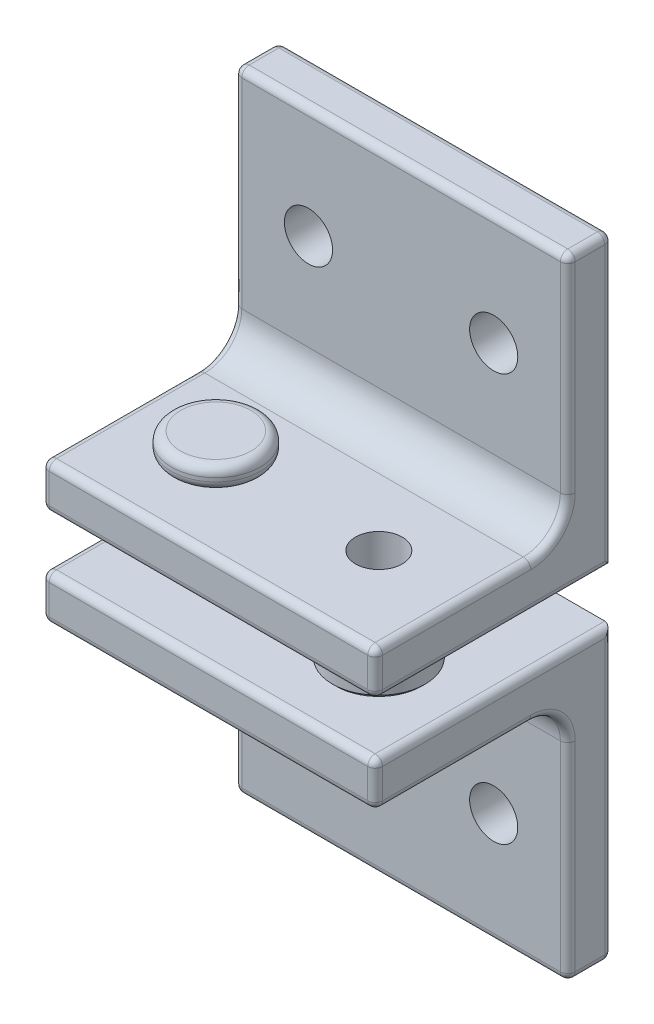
ISO-10303-21;
HEADER;
FILE_DESCRIPTION(('STEP AP214'),'2;1');
FILE_NAME('part.step','',(''),(''),'','','');
FILE_SCHEMA(('AUTOMOTIVE_DESIGN { 1 0 10303 214 1 1 1 1 }'));
ENDSEC;
DATA;
#1=APPLICATION_CONTEXT('core data for automotive mechanical design processes');
#2=APPLICATION_PROTOCOL_DEFINITION('international standard','automotive_design',2000,#1);
#3=PRODUCT_CONTEXT('',#1,'mechanical');
#4=PRODUCT('Part','Part','',(#3));
#5=PRODUCT_RELATED_PRODUCT_CATEGORY('part','',(#4));
#6=PRODUCT_DEFINITION_FORMATION('','',#4);
#7=PRODUCT_DEFINITION_CONTEXT('part definition',#1,'design');
#8=PRODUCT_DEFINITION('design','',#6,#7);
#9=PRODUCT_DEFINITION_SHAPE('','',#8);
#10=(LENGTH_UNIT() NAMED_UNIT(*) SI_UNIT(.MILLI.,.METRE.));
#11=(NAMED_UNIT(*) PLANE_ANGLE_UNIT() SI_UNIT($,.RADIAN.));
#12=(NAMED_UNIT(*) SI_UNIT($,.STERADIAN.) SOLID_ANGLE_UNIT());
#13=UNCERTAINTY_MEASURE_WITH_UNIT(LENGTH_MEASURE(1.E-05),#10,'distance_accuracy_value','');
#14=(GEOMETRIC_REPRESENTATION_CONTEXT(3) GLOBAL_UNCERTAINTY_ASSIGNED_CONTEXT((#13)) GLOBAL_UNIT_ASSIGNED_CONTEXT((#10,
#11,#12)) REPRESENTATION_CONTEXT('',''));
#15=CARTESIAN_POINT('',(0.,0.,0.));
#16=DIRECTION('',(0.,0.,1.));
#17=DIRECTION('',(1.,0.,0.));
#18=AXIS2_PLACEMENT_3D('',#15,#16,#17);
#19=CARTESIAN_POINT('',(23.5000138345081,23.9999864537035,19.9999999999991));
#20=DIRECTION('',(5.76437990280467E-07,0.999999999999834,0.));
#21=DIRECTION('',(-0.99999942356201,5.76437658E-07,0.001073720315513));
#22=AXIS2_PLACEMENT_3D('',#19,#20,#21);
#23=CYLINDRICAL_SURFACE('',#22,6.25);
#24=CARTESIAN_POINT('',(23.500017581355,30.4999864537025,19.9999999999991));
#25=DIRECTION('',(-5.76437990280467E-07,-0.999999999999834,0.));
#26=DIRECTION('',(0.99999942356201,-5.76437658E-07,-0.001073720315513));
#27=AXIS2_PLACEMENT_3D('',#24,#25,#26);
#28=CIRCLE('',#27,6.25);
#29=CARTESIAN_POINT('',(29.7500139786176,30.4999828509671,19.9932892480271));
#30=VERTEX_POINT('',#29);
#31=EDGE_CURVE('E25',#30,#30,#28,.T.);
#32=ORIENTED_EDGE('',*,*,#31,.T.);
#33=EDGE_LOOP('',(#32));
#34=FACE_BOUND('',#33,.T.);
#35=CARTESIAN_POINT('',(23.5000141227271,24.4999864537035,19.9999999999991));
#36=DIRECTION('',(5.76437990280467E-07,0.999999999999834,0.));
#37=DIRECTION('',(0.99999942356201,-5.76437658E-07,-0.001073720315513));
#38=AXIS2_PLACEMENT_3D('',#35,#36,#37);
#39=CIRCLE('',#38,6.25);
#40=CARTESIAN_POINT('',(29.7500105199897,24.4999828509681,19.9932892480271));
#41=VERTEX_POINT('',#40);
#42=EDGE_CURVE('E9',#41,#41,#39,.T.);
#43=ORIENTED_EDGE('',*,*,#42,.T.);
#44=EDGE_LOOP('',(#43));
#45=FACE_BOUND('',#44,.T.);
#46=ADVANCED_FACE('F14',(#34,#45),#23,.T.);
#47=CARTESIAN_POINT('',(23.5000138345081,23.9999864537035,19.9999999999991));
#48=DIRECTION('',(5.76437990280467E-07,0.999999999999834,0.));
#49=DIRECTION('',(-0.99999942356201,5.76437658E-07,0.001073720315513));
#50=AXIS2_PLACEMENT_3D('',#47,#48,#49);
#51=CONICAL_SURFACE('',#50,5.75,0.785398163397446);
#52=ORIENTED_EDGE('',*,*,#42,.F.);
#53=EDGE_LOOP('',(#52));
#54=FACE_BOUND('',#53,.T.);
#55=CARTESIAN_POINT('',(23.5000138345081,23.9999864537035,19.9999999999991));
#56=DIRECTION('',(-5.76437990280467E-07,-0.999999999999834,0.));
#57=DIRECTION('',(0.99999942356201,-5.76437658E-07,-0.001073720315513));
#58=AXIS2_PLACEMENT_3D('',#55,#56,#57);
#59=CIRCLE('',#58,5.75);
#60=CARTESIAN_POINT('',(29.2500105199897,23.999983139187,19.9938261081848));
#61=VERTEX_POINT('',#60);
#62=EDGE_CURVE('E947',#61,#61,#59,.T.);
#63=ORIENTED_EDGE('',*,*,#62,.F.);
#64=EDGE_LOOP('',(#63));
#65=FACE_BOUND('',#64,.T.);
#66=ADVANCED_FACE('F962',(#54,#65),#51,.T.);
#67=CARTESIAN_POINT('',(23.500017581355,30.4999864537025,19.9999999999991));
#68=DIRECTION('',(-5.76437990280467E-07,-0.999999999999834,0.));
#69=DIRECTION('',(0.99999942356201,-5.76437658E-07,-0.001073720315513));
#70=AXIS2_PLACEMENT_3D('',#67,#68,#69);
#71=CONICAL_SURFACE('',#70,6.25,0.78539816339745);
#72=ORIENTED_EDGE('',*,*,#31,.F.);
#73=EDGE_LOOP('',(#72));
#74=FACE_BOUND('',#73,.T.);
#75=CARTESIAN_POINT('',(23.500017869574,30.9999864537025,19.999999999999));
#76=DIRECTION('',(5.76437990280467E-07,0.999999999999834,0.));
#77=DIRECTION('',(0.99999942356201,-5.76437658E-07,-0.001073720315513));
#78=AXIS2_PLACEMENT_3D('',#75,#76,#77);
#79=CIRCLE('',#78,5.75);
#80=CARTESIAN_POINT('',(29.2500145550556,30.999983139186,19.9938261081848));
#81=VERTEX_POINT('',#80);
#82=EDGE_CURVE('E910',#81,#81,#79,.T.);
#83=ORIENTED_EDGE('',*,*,#82,.F.);
#84=EDGE_LOOP('',(#83));
#85=FACE_BOUND('',#84,.T.);
#86=ADVANCED_FACE('F959',(#74,#85),#71,.T.);
#87=CARTESIAN_POINT('',(1.50002305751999,39.9999991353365,20.));
#88=DIRECTION('',(-5.76437990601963E-07,-0.999999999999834,0.));
#89=DIRECTION('',(0.734988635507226,-4.23675372E-07,-0.678079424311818));
#90=AXIS2_PLACEMENT_3D('',#87,#88,#89);
#91=PLANE('',#90);
#92=CARTESIAN_POINT('',(1.50002305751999,39.9999991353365,20.));
#93=DIRECTION('',(5.76437990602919E-07,0.999999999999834,0.));
#94=DIRECTION('',(0.734988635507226,-4.23675372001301E-07,-0.678079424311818));
#95=AXIS2_PLACEMENT_3D('',#92,#93,#94);
#96=CIRCLE('',#95,4.75);
#97=CARTESIAN_POINT('',(4.99121907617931,39.9999971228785,16.7791227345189));
#98=VERTEX_POINT('',#97);
#99=EDGE_CURVE('E929',#98,#98,#96,.T.);
#100=ORIENTED_EDGE('',*,*,#99,.T.);
#101=EDGE_LOOP('',(#100));
#102=FACE_BOUND('',#101,.T.);
#103=ADVANCED_FACE('F961',(#102),#91,.F.);
#104=CARTESIAN_POINT('',(1.50000864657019,14.9999991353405,20.));
#105=DIRECTION('',(-5.76437990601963E-07,-0.999999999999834,0.));
#106=DIRECTION('',(0.734988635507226,-4.23675372E-07,-0.678079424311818));
#107=AXIS2_PLACEMENT_3D('',#104,#105,#106);
#108=PLANE('',#107);
#109=CARTESIAN_POINT('',(1.50000864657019,14.9999991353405,20.));
#110=DIRECTION('',(-5.76437990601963E-07,-0.999999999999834,0.));
#111=DIRECTION('',(0.734988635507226,-4.23675372E-07,-0.678079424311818));
#112=AXIS2_PLACEMENT_3D('',#109,#110,#111);
#113=CIRCLE('',#112,4.75);
#114=CARTESIAN_POINT('',(4.99120466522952,14.9999971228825,16.7791227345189));
#115=VERTEX_POINT('',#114);
#116=EDGE_CURVE('E832',#115,#115,#113,.T.);
#117=ORIENTED_EDGE('',*,*,#116,.T.);
#118=EDGE_LOOP('',(#117));
#119=FACE_BOUND('',#118,.T.);
#120=ADVANCED_FACE('F972',(#119),#108,.T.);
#121=CARTESIAN_POINT('',(1.50002233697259,38.749999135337,20.));
#122=DIRECTION('',(-5.76437990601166E-07,-0.999999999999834,0.));
#123=DIRECTION('',(0.734988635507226,-4.23675371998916E-07,-0.678079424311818));
#124=AXIS2_PLACEMENT_3D('',#121,#122,#123);
#125=TOROIDAL_SURFACE('',#124,4.75,1.25);
#126=CARTESIAN_POINT('',(1.50002233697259,38.749999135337,20.));
#127=DIRECTION('',(-5.76437990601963E-07,-0.999999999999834,0.));
#128=DIRECTION('',(0.734988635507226,-4.23675372E-07,-0.678079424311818));
#129=AXIS2_PLACEMENT_3D('',#126,#127,#128);
#130=CIRCLE('',#129,6.);
#131=CARTESIAN_POINT('',(5.90995415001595,38.7499965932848,15.9315234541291));
#132=VERTEX_POINT('',#131);
#133=EDGE_CURVE('E924',#132,#132,#130,.T.);
#134=ORIENTED_EDGE('',*,*,#133,.F.);
#135=EDGE_LOOP('',(#134));
#136=FACE_BOUND('',#135,.T.);
#137=ORIENTED_EDGE('',*,*,#99,.F.);
#138=EDGE_LOOP('',(#137));
#139=FACE_BOUND('',#138,.T.);
#140=ADVANCED_FACE('F975',(#136,#139),#125,.T.);
#141=CARTESIAN_POINT('',(1.50000936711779,16.2499991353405,20.));
#142=DIRECTION('',(-5.76437990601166E-07,-0.999999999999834,0.));
#143=DIRECTION('',(0.734988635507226,-4.23675371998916E-07,-0.678079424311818));
#144=AXIS2_PLACEMENT_3D('',#141,#142,#143);
#145=TOROIDAL_SURFACE('',#144,4.75,1.25);
#146=ORIENTED_EDGE('',*,*,#116,.F.);
#147=EDGE_LOOP('',(#146));
#148=FACE_BOUND('',#147,.T.);
#149=CARTESIAN_POINT('',(1.50000936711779,16.2499991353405,20.));
#150=DIRECTION('',(5.76437990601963E-07,0.999999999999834,0.));
#151=DIRECTION('',(0.734988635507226,-4.23675372E-07,-0.678079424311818));
#152=AXIS2_PLACEMENT_3D('',#149,#150,#151);
#153=CIRCLE('',#152,6.);
#154=CARTESIAN_POINT('',(5.90994118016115,16.2499965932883,15.9315234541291));
#155=VERTEX_POINT('',#154);
#156=EDGE_CURVE('E923',#155,#155,#153,.T.);
#157=ORIENTED_EDGE('',*,*,#156,.F.);
#158=EDGE_LOOP('',(#157));
#159=FACE_BOUND('',#158,.T.);
#160=ADVANCED_FACE('F1336',(#148,#159),#145,.T.);
#161=CARTESIAN_POINT('',(1.50002132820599,36.999999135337,20.));
#162=DIRECTION('',(5.76437990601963E-07,0.999999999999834,0.));
#163=DIRECTION('',(-0.734988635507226,4.23675372E-07,0.678079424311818));
#164=AXIS2_PLACEMENT_3D('',#161,#162,#163);
#165=CYLINDRICAL_SURFACE('',#164,6.);
#166=ORIENTED_EDGE('',*,*,#133,.T.);
#167=EDGE_LOOP('',(#166));
#168=FACE_BOUND('',#167,.T.);
#169=CARTESIAN_POINT('',(1.50002204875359,38.249999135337,20.));
#170=DIRECTION('',(5.76437990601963E-07,0.999999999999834,0.));
#171=DIRECTION('',(0.734988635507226,-4.23675372E-07,-0.678079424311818));
#172=AXIS2_PLACEMENT_3D('',#169,#170,#171);
#173=CIRCLE('',#172,6.);
#174=CARTESIAN_POINT('',(5.90995386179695,38.2499965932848,15.9315234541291));
#175=VERTEX_POINT('',#174);
#176=EDGE_CURVE('E919',#175,#175,#173,.T.);
#177=ORIENTED_EDGE('',*,*,#176,.T.);
#178=EDGE_LOOP('',(#177));
#179=FACE_BOUND('',#178,.T.);
#180=ADVANCED_FACE('F1323',(#168,#179),#165,.T.);
#181=CARTESIAN_POINT('',(34.0000397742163,68.9999804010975,4.999999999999));
#182=DIRECTION('',(0.,0.,1.));
#183=DIRECTION('',(5.7643799E-07,0.999999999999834,0.));
#184=AXIS2_PLACEMENT_3D('',#181,#182,#183);
#185=SPHERICAL_SURFACE('',#184,1.);
#186=CARTESIAN_POINT('',(34.0000397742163,68.9999804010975,4.999999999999));
#187=DIRECTION('',(5.76437983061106E-07,0.999999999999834,0.));
#188=DIRECTION('',(-0.999999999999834,5.76437983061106E-07,0.));
#189=AXIS2_PLACEMENT_3D('',#186,#187,#188);
#190=CIRCLE('',#189,1.);
#191=CARTESIAN_POINT('',(34.0000397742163,68.9999804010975,5.999999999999));
#192=VERTEX_POINT('',#191);
#193=CARTESIAN_POINT('',(35.0000397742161,68.9999798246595,4.999999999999));
#194=VERTEX_POINT('',#193);
#195=EDGE_CURVE('E693',#192,#194,#190,.T.);
#196=ORIENTED_EDGE('',*,*,#195,.T.);
#197=CARTESIAN_POINT('',(34.0000397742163,68.9999804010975,4.999999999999));
#198=DIRECTION('',(0.,0.,1.));
#199=DIRECTION('',(0.999999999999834,-5.7643799E-07,0.));
#200=AXIS2_PLACEMENT_3D('',#197,#198,#199);
#201=CIRCLE('',#200,1.);
#202=CARTESIAN_POINT('',(34.0000403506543,69.9999804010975,4.999999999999));
#203=VERTEX_POINT('',#202);
#204=EDGE_CURVE('E698',#194,#203,#201,.T.);
#205=ORIENTED_EDGE('',*,*,#204,.T.);
#206=CARTESIAN_POINT('',(34.0000397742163,68.9999804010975,4.999999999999));
#207=DIRECTION('',(-0.999999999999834,5.7643799E-07,0.));
#208=DIRECTION('',(5.7643799E-07,0.999999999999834,0.));
#209=AXIS2_PLACEMENT_3D('',#206,#207,#208);
#210=CIRCLE('',#209,1.);
#211=EDGE_CURVE('E766',#192,#203,#210,.T.);
#212=ORIENTED_EDGE('',*,*,#211,.F.);
#213=EDGE_LOOP('',(#196,#205,#212));
#214=FACE_BOUND('',#213,.T.);
#215=ADVANCED_FACE('F1335',(#214),#185,.T.);
#216=CARTESIAN_POINT('',(35.0000397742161,68.9999798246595,4.999999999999));
#217=DIRECTION('',(-0.999999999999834,5.7643799E-07,0.));
#218=DIRECTION('',(-5.7643799E-07,-0.999999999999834,0.));
#219=AXIS2_PLACEMENT_3D('',#216,#217,#218);
#220=CYLINDRICAL_SURFACE('',#219,1.);
#221=ORIENTED_EDGE('',*,*,#211,.T.);
#222=DIRECTION('',(0.999999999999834,-5.76437989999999E-07,0.));
#223=VECTOR('',#222,1.);
#224=CARTESIAN_POINT('',(35.0000403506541,69.9999798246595,4.999999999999));
#225=LINE('',#224,#223);
#226=CARTESIAN_POINT('',(-8.9999596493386,70.0000051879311,4.999999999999));
#227=VERTEX_POINT('',#226);
#228=EDGE_CURVE('E820',#227,#203,#225,.T.);
#229=ORIENTED_EDGE('',*,*,#228,.F.);
#230=CARTESIAN_POINT('',(-8.99996022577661,69.0000051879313,4.999999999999));
#231=DIRECTION('',(-0.999999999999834,5.7643799E-07,0.));
#232=DIRECTION('',(-5.7643799E-07,-0.999999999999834,0.));
#233=AXIS2_PLACEMENT_3D('',#230,#231,#232);
#234=CIRCLE('',#233,1.);
#235=CARTESIAN_POINT('',(-8.99996022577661,69.0000051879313,5.999999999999));
#236=VERTEX_POINT('',#235);
#237=EDGE_CURVE('E621',#236,#227,#234,.T.);
#238=ORIENTED_EDGE('',*,*,#237,.F.);
#239=DIRECTION('',(-0.999999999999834,5.76437989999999E-07,0.));
#240=VECTOR('',#239,1.);
#241=CARTESIAN_POINT('',(35.0000397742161,68.9999798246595,5.999999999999));
#242=LINE('',#241,#240);
#243=EDGE_CURVE('E645',#192,#236,#242,.T.);
#244=ORIENTED_EDGE('',*,*,#243,.F.);
#245=EDGE_LOOP('',(#221,#229,#238,#244));
#246=FACE_BOUND('',#245,.T.);
#247=ADVANCED_FACE('F1343',(#246),#220,.T.);
#248=CARTESIAN_POINT('',(-8.99996022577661,69.0000051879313,4.999999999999));
#249=DIRECTION('',(0.,0.,1.));
#250=DIRECTION('',(5.7643799E-07,0.999999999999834,0.));
#251=AXIS2_PLACEMENT_3D('',#248,#249,#250);
#252=SPHERICAL_SURFACE('',#251,1.);
#253=ORIENTED_EDGE('',*,*,#237,.T.);
#254=CARTESIAN_POINT('',(-8.99996022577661,69.0000051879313,4.999999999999));
#255=DIRECTION('',(0.,0.,1.));
#256=DIRECTION('',(0.999999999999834,-5.7643799E-07,0.));
#257=AXIS2_PLACEMENT_3D('',#254,#255,#256);
#258=CIRCLE('',#257,1.);
#259=CARTESIAN_POINT('',(-9.99996022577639,69.0000057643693,4.999999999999));
#260=VERTEX_POINT('',#259);
#261=EDGE_CURVE('E618',#227,#260,#258,.T.);
#262=ORIENTED_EDGE('',*,*,#261,.T.);
#263=CARTESIAN_POINT('',(-8.99996022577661,69.0000051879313,4.999999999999));
#264=DIRECTION('',(-5.7643799E-07,-0.999999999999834,0.));
#265=DIRECTION('',(0.,0.,1.));
#266=AXIS2_PLACEMENT_3D('',#263,#264,#265);
#267=CIRCLE('',#266,1.);
#268=EDGE_CURVE('E792',#236,#260,#267,.T.);
#269=ORIENTED_EDGE('',*,*,#268,.F.);
#270=EDGE_LOOP('',(#253,#262,#269));
#271=FACE_BOUND('',#270,.T.);
#272=ADVANCED_FACE('F999',(#271),#252,.T.);
#273=CARTESIAN_POINT('',(-8.99997924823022,36.0000051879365,30.999999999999));
#274=DIRECTION('',(0.,0.,1.));
#275=DIRECTION('',(5.7643799E-07,0.999999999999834,0.));
#276=AXIS2_PLACEMENT_3D('',#273,#274,#275);
#277=SPHERICAL_SURFACE('',#276,1.);
#278=CARTESIAN_POINT('',(-8.99997924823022,36.0000051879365,30.999999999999));
#279=DIRECTION('',(5.7643799E-07,0.999999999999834,0.));
#280=DIRECTION('',(0.,0.,1.));
#281=AXIS2_PLACEMENT_3D('',#278,#279,#280);
#282=CIRCLE('',#281,1.);
#283=CARTESIAN_POINT('',(-9.99997924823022,36.0000057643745,30.999999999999));
#284=VERTEX_POINT('',#283);
#285=CARTESIAN_POINT('',(-8.99997924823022,36.000005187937,31.999999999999));
#286=VERTEX_POINT('',#285);
#287=EDGE_CURVE('E655',#284,#286,#282,.T.);
#288=ORIENTED_EDGE('',*,*,#287,.T.);
#289=CARTESIAN_POINT('',(-8.99997924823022,36.0000051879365,30.999999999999));
#290=DIRECTION('',(-0.999999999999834,5.7643799E-07,0.));
#291=DIRECTION('',(-5.7643799E-07,-0.999999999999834,0.));
#292=AXIS2_PLACEMENT_3D('',#289,#290,#291);
#293=CIRCLE('',#292,1.);
#294=CARTESIAN_POINT('',(-8.99997867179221,37.0000051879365,30.999999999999));
#295=VERTEX_POINT('',#294);
#296=EDGE_CURVE('E651',#286,#295,#293,.T.);
#297=ORIENTED_EDGE('',*,*,#296,.T.);
#298=CARTESIAN_POINT('',(-8.99997924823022,36.0000051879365,30.999999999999));
#299=DIRECTION('',(0.,0.,-1.));
#300=DIRECTION('',(0.999999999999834,-5.7643799E-07,0.));
#301=AXIS2_PLACEMENT_3D('',#298,#299,#300);
#302=CIRCLE('',#301,1.);
#303=EDGE_CURVE('E652',#284,#295,#302,.T.);
#304=ORIENTED_EDGE('',*,*,#303,.F.);
#305=EDGE_LOOP('',(#288,#297,#304));
#306=FACE_BOUND('',#305,.T.);
#307=ADVANCED_FACE('F1018',(#306),#277,.T.);
#308=CARTESIAN_POINT('',(34.0000207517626,35.999980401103,30.999999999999));
#309=DIRECTION('',(0.,0.,1.));
#310=DIRECTION('',(5.7643799E-07,0.999999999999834,0.));
#311=AXIS2_PLACEMENT_3D('',#308,#309,#310);
#312=SPHERICAL_SURFACE('',#311,1.);
#313=CARTESIAN_POINT('',(34.0000207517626,35.999980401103,30.999999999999));
#314=DIRECTION('',(5.76437989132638E-07,0.999999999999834,0.));
#315=DIRECTION('',(-0.999999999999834,5.76437989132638E-07,0.));
#316=AXIS2_PLACEMENT_3D('',#313,#314,#315);
#317=CIRCLE('',#316,1.);
#318=CARTESIAN_POINT('',(34.0000207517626,35.999980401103,31.999999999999));
#319=VERTEX_POINT('',#318);
#320=CARTESIAN_POINT('',(35.0000207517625,35.999979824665,30.999999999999));
#321=VERTEX_POINT('',#320);
#322=EDGE_CURVE('E744',#319,#321,#317,.T.);
#323=ORIENTED_EDGE('',*,*,#322,.T.);
#324=CARTESIAN_POINT('',(34.0000207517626,35.999980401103,30.999999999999));
#325=DIRECTION('',(0.,0.,1.));
#326=DIRECTION('',(0.999999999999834,-5.7643799E-07,0.));
#327=AXIS2_PLACEMENT_3D('',#324,#325,#326);
#328=CIRCLE('',#327,1.);
#329=CARTESIAN_POINT('',(34.0000213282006,36.999980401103,30.999999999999));
#330=VERTEX_POINT('',#329);
#331=EDGE_CURVE('E639',#321,#330,#328,.T.);
#332=ORIENTED_EDGE('',*,*,#331,.T.);
#333=CARTESIAN_POINT('',(34.0000207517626,35.999980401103,30.999999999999));
#334=DIRECTION('',(-0.999999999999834,5.7643799E-07,0.));
#335=DIRECTION('',(5.7643799E-07,0.999999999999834,1.2490009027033E-13));
#336=AXIS2_PLACEMENT_3D('',#333,#334,#335);
#337=CIRCLE('',#336,1.);
#338=EDGE_CURVE('E622',#319,#330,#337,.T.);
#339=ORIENTED_EDGE('',*,*,#338,.F.);
#340=EDGE_LOOP('',(#323,#332,#339));
#341=FACE_BOUND('',#340,.T.);
#342=ADVANCED_FACE('F1021',(#341),#312,.T.);
#343=CARTESIAN_POINT('',(1.50001037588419,17.99999913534,20.));
#344=DIRECTION('',(-5.76437990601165E-07,-0.999999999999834,0.));
#345=DIRECTION('',(-0.678079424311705,3.90870741E-07,-0.734988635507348));
#346=AXIS2_PLACEMENT_3D('',#343,#344,#345);
#347=CYLINDRICAL_SURFACE('',#346,6.);
#348=ORIENTED_EDGE('',*,*,#156,.T.);
#349=EDGE_LOOP('',(#348));
#350=FACE_BOUND('',#349,.T.);
#351=CARTESIAN_POINT('',(1.5000096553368,16.7499991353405,20.));
#352=DIRECTION('',(-5.76437990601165E-07,-0.999999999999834,0.));
#353=DIRECTION('',(0.678079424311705,-3.90870741E-07,0.734988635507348));
#354=AXIS2_PLACEMENT_3D('',#351,#352,#353);
#355=CIRCLE('',#354,6.);
#356=CARTESIAN_POINT('',(5.56848620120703,16.7499967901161,24.4099318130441));
#357=VERTEX_POINT('',#356);
#358=EDGE_CURVE('E914',#357,#357,#355,.T.);
#359=ORIENTED_EDGE('',*,*,#358,.T.);
#360=EDGE_LOOP('',(#359));
#361=FACE_BOUND('',#360,.T.);
#362=ADVANCED_FACE('F1034',(#350,#361),#347,.T.);
#363=CARTESIAN_POINT('',(-9.00000807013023,-13.9999948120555,4.999999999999));
#364=DIRECTION('',(0.,0.,1.));
#365=DIRECTION('',(-5.7643799E-07,-0.999999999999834,0.));
#366=AXIS2_PLACEMENT_3D('',#363,#364,#365);
#367=SPHERICAL_SURFACE('',#366,1.);
#368=CARTESIAN_POINT('',(-9.00000807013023,-13.9999948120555,4.999999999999));
#369=DIRECTION('',(-5.76437983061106E-07,-0.999999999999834,0.));
#370=DIRECTION('',(0.999999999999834,-5.76437983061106E-07,0.));
#371=AXIS2_PLACEMENT_3D('',#368,#369,#370);
#372=CIRCLE('',#371,1.);
#373=CARTESIAN_POINT('',(-9.00000807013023,-13.9999948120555,5.999999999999));
#374=VERTEX_POINT('',#373);
#375=CARTESIAN_POINT('',(-10.0000080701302,-13.9999942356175,4.999999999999));
#376=VERTEX_POINT('',#375);
#377=EDGE_CURVE('E509',#374,#376,#372,.T.);
#378=ORIENTED_EDGE('',*,*,#377,.T.);
#379=CARTESIAN_POINT('',(-9.00000807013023,-13.9999948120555,4.999999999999));
#380=DIRECTION('',(0.,0.,1.));
#381=DIRECTION('',(-0.999999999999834,5.7643799E-07,0.));
#382=AXIS2_PLACEMENT_3D('',#379,#380,#381);
#383=CIRCLE('',#382,1.);
#384=CARTESIAN_POINT('',(-9.00000864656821,-14.9999948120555,4.999999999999));
#385=VERTEX_POINT('',#384);
#386=EDGE_CURVE('E452',#376,#385,#383,.T.);
#387=ORIENTED_EDGE('',*,*,#386,.T.);
#388=CARTESIAN_POINT('',(-9.00000807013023,-13.9999948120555,4.999999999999));
#389=DIRECTION('',(0.999999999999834,-5.7643799E-07,0.));
#390=DIRECTION('',(-5.7643799E-07,-0.999999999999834,0.));
#391=AXIS2_PLACEMENT_3D('',#388,#389,#390);
#392=CIRCLE('',#391,1.);
#393=EDGE_CURVE('E409',#374,#385,#392,.T.);
#394=ORIENTED_EDGE('',*,*,#393,.F.);
#395=EDGE_LOOP('',(#378,#387,#394));
#396=FACE_BOUND('',#395,.T.);
#397=ADVANCED_FACE('F1050',(#396),#367,.T.);
#398=CARTESIAN_POINT('',(-10.0000080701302,-13.9999942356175,4.999999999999));
#399=DIRECTION('',(0.999999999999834,-5.7643799E-07,0.));
#400=DIRECTION('',(5.7643799E-07,0.999999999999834,0.));
#401=AXIS2_PLACEMENT_3D('',#398,#399,#400);
#402=CYLINDRICAL_SURFACE('',#401,1.);
#403=ORIENTED_EDGE('',*,*,#393,.T.);
#404=DIRECTION('',(-0.999999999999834,5.76437989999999E-07,0.));
#405=VECTOR('',#404,1.);
#406=CARTESIAN_POINT('',(-10.0000086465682,-14.9999942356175,4.999999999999));
#407=LINE('',#406,#405);
#408=CARTESIAN_POINT('',(33.9999913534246,-15.000019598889,4.999999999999));
#409=VERTEX_POINT('',#408);
#410=EDGE_CURVE('E383',#409,#385,#407,.T.);
#411=ORIENTED_EDGE('',*,*,#410,.F.);
#412=CARTESIAN_POINT('',(33.9999919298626,-14.000019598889,4.999999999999));
#413=DIRECTION('',(0.999999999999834,-5.7643799E-07,0.));
#414=DIRECTION('',(5.7643799E-07,0.999999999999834,0.));
#415=AXIS2_PLACEMENT_3D('',#412,#413,#414);
#416=CIRCLE('',#415,1.);
#417=CARTESIAN_POINT('',(33.9999919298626,-14.000019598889,5.999999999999));
#418=VERTEX_POINT('',#417);
#419=EDGE_CURVE('E485',#418,#409,#416,.T.);
#420=ORIENTED_EDGE('',*,*,#419,.F.);
#421=DIRECTION('',(0.999999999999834,-5.76437989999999E-07,0.));
#422=VECTOR('',#421,1.);
#423=CARTESIAN_POINT('',(-10.0000080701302,-13.9999942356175,5.999999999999));
#424=LINE('',#423,#422);
#425=EDGE_CURVE('E411',#374,#418,#424,.T.);
#426=ORIENTED_EDGE('',*,*,#425,.F.);
#427=EDGE_LOOP('',(#403,#411,#420,#426));
#428=FACE_BOUND('',#427,.T.);
#429=ADVANCED_FACE('F1080',(#428),#402,.T.);
#430=CARTESIAN_POINT('',(33.9999919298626,-14.000019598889,4.999999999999));
#431=DIRECTION('',(0.,0.,1.));
#432=DIRECTION('',(-5.7643799E-07,-0.999999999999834,0.));
#433=AXIS2_PLACEMENT_3D('',#430,#431,#432);
#434=SPHERICAL_SURFACE('',#433,1.);
#435=ORIENTED_EDGE('',*,*,#419,.T.);
#436=CARTESIAN_POINT('',(33.9999919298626,-14.000019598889,4.999999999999));
#437=DIRECTION('',(0.,0.,1.));
#438=DIRECTION('',(-0.999999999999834,5.7643799E-07,0.));
#439=AXIS2_PLACEMENT_3D('',#436,#437,#438);
#440=CIRCLE('',#439,1.);
#441=CARTESIAN_POINT('',(34.9999919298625,-14.000020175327,4.999999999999));
#442=VERTEX_POINT('',#441);
#443=EDGE_CURVE('E18',#409,#442,#440,.T.);
#444=ORIENTED_EDGE('',*,*,#443,.T.);
#445=CARTESIAN_POINT('',(33.9999919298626,-14.000019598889,4.999999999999));
#446=DIRECTION('',(5.7643799E-07,0.999999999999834,0.));
#447=DIRECTION('',(0.,0.,1.));
#448=AXIS2_PLACEMENT_3D('',#445,#446,#447);
#449=CIRCLE('',#448,1.);
#450=EDGE_CURVE('E435',#418,#442,#449,.T.);
#451=ORIENTED_EDGE('',*,*,#450,.F.);
#452=EDGE_LOOP('',(#435,#444,#451));
#453=FACE_BOUND('',#452,.T.);
#454=ADVANCED_FACE('F1096',(#453),#434,.T.);
#455=CARTESIAN_POINT('',(34.0000109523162,18.9999804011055,30.999999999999));
#456=DIRECTION('',(0.,0.,1.));
#457=DIRECTION('',(-5.7643799E-07,-0.999999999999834,0.));
#458=AXIS2_PLACEMENT_3D('',#455,#456,#457);
#459=SPHERICAL_SURFACE('',#458,1.);
#460=CARTESIAN_POINT('',(34.0000109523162,18.9999804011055,30.999999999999));
#461=DIRECTION('',(-5.7643799E-07,-0.999999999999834,0.));
#462=DIRECTION('',(0.,0.,1.));
#463=AXIS2_PLACEMENT_3D('',#460,#461,#462);
#464=CIRCLE('',#463,1.);
#465=CARTESIAN_POINT('',(35.0000109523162,18.9999798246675,30.999999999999));
#466=VERTEX_POINT('',#465);
#467=CARTESIAN_POINT('',(34.0000109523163,18.999980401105,31.999999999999));
#468=VERTEX_POINT('',#467);
#469=EDGE_CURVE('E544',#466,#468,#464,.T.);
#470=ORIENTED_EDGE('',*,*,#469,.T.);
#471=CARTESIAN_POINT('',(34.0000109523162,18.9999804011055,30.999999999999));
#472=DIRECTION('',(0.999999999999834,-5.7643799E-07,0.));
#473=DIRECTION('',(5.7643799E-07,0.999999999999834,0.));
#474=AXIS2_PLACEMENT_3D('',#471,#472,#473);
#475=CIRCLE('',#474,1.);
#476=CARTESIAN_POINT('',(34.0000103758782,17.9999804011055,30.999999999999));
#477=VERTEX_POINT('',#476);
#478=EDGE_CURVE('E541',#468,#477,#475,.T.);
#479=ORIENTED_EDGE('',*,*,#478,.T.);
#480=CARTESIAN_POINT('',(34.0000109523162,18.9999804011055,30.999999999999));
#481=DIRECTION('',(0.,0.,-1.));
#482=DIRECTION('',(-0.999999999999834,5.7643799E-07,0.));
#483=AXIS2_PLACEMENT_3D('',#480,#481,#482);
#484=CIRCLE('',#483,1.);
#485=EDGE_CURVE('E341',#466,#477,#484,.T.);
#486=ORIENTED_EDGE('',*,*,#485,.F.);
#487=EDGE_LOOP('',(#470,#479,#486));
#488=FACE_BOUND('',#487,.T.);
#489=ADVANCED_FACE('F1099',(#488),#459,.T.);
#490=CARTESIAN_POINT('',(-8.99998904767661,19.0000051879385,30.999999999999));
#491=DIRECTION('',(0.,0.,1.));
#492=DIRECTION('',(-5.7643799E-07,-0.999999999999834,0.));
#493=AXIS2_PLACEMENT_3D('',#490,#491,#492);
#494=SPHERICAL_SURFACE('',#493,1.);
#495=CARTESIAN_POINT('',(-8.99998904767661,19.0000051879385,30.999999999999));
#496=DIRECTION('',(-5.76437989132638E-07,-0.999999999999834,0.));
#497=DIRECTION('',(0.999999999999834,-5.76437989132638E-07,0.));
#498=AXIS2_PLACEMENT_3D('',#495,#496,#497);
#499=CIRCLE('',#498,1.);
#500=CARTESIAN_POINT('',(-8.99998904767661,19.000005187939,31.999999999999));
#501=VERTEX_POINT('',#500);
#502=CARTESIAN_POINT('',(-9.99998904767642,19.0000057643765,30.999999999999));
#503=VERTEX_POINT('',#502);
#504=EDGE_CURVE('E405',#501,#503,#499,.T.);
#505=ORIENTED_EDGE('',*,*,#504,.T.);
#506=CARTESIAN_POINT('',(-8.99998904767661,19.0000051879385,30.999999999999));
#507=DIRECTION('',(0.,0.,1.));
#508=DIRECTION('',(-0.999999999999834,5.7643799E-07,0.));
#509=AXIS2_PLACEMENT_3D('',#506,#507,#508);
#510=CIRCLE('',#509,1.);
#511=CARTESIAN_POINT('',(-8.99998962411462,18.000005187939,30.999999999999));
#512=VERTEX_POINT('',#511);
#513=EDGE_CURVE('E410',#503,#512,#510,.T.);
#514=ORIENTED_EDGE('',*,*,#513,.T.);
#515=CARTESIAN_POINT('',(-8.99998904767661,19.0000051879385,30.999999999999));
#516=DIRECTION('',(0.999999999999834,-5.7643799E-07,0.));
#517=DIRECTION('',(-5.7643799E-07,-0.999999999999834,1.2490009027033E-13));
#518=AXIS2_PLACEMENT_3D('',#515,#516,#517);
#519=CIRCLE('',#518,1.);
#520=EDGE_CURVE('E434',#501,#512,#519,.T.);
#521=ORIENTED_EDGE('',*,*,#520,.F.);
#522=EDGE_LOOP('',(#505,#514,#521));
#523=FACE_BOUND('',#522,.T.);
#524=ADVANCED_FACE('F16',(#523),#494,.T.);
#525=CARTESIAN_POINT('',(1.50002204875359,38.249999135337,20.));
#526=DIRECTION('',(-5.76437990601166E-07,-0.999999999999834,0.));
#527=DIRECTION('',(0.734988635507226,-4.23675371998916E-07,-0.678079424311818));
#528=AXIS2_PLACEMENT_3D('',#525,#526,#527);
#529=TOROIDAL_SURFACE('',#528,4.75,1.25);
#530=CARTESIAN_POINT('',(1.50002132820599,36.999999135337,20.));
#531=DIRECTION('',(-5.76437990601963E-07,-0.999999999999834,0.));
#532=DIRECTION('',(0.734988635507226,-4.23675372E-07,-0.678079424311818));
#533=AXIS2_PLACEMENT_3D('',#530,#531,#532);
#534=CIRCLE('',#533,4.75);
#535=CARTESIAN_POINT('',(4.99121734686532,36.999997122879,16.7791227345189));
#536=VERTEX_POINT('',#535);
#537=EDGE_CURVE('E925',#536,#536,#534,.T.);
#538=ORIENTED_EDGE('',*,*,#537,.F.);
#539=EDGE_LOOP('',(#538));
#540=FACE_BOUND('',#539,.T.);
#541=ORIENTED_EDGE('',*,*,#176,.F.);
#542=EDGE_LOOP('',(#541));
#543=FACE_BOUND('',#542,.T.);
#544=ADVANCED_FACE('F1101',(#540,#543),#529,.T.);
#545=CARTESIAN_POINT('',(34.0000207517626,35.999980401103,-9.72263280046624E-13));
#546=DIRECTION('',(0.,0.,1.));
#547=DIRECTION('',(0.999999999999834,-5.7643799E-07,0.));
#548=AXIS2_PLACEMENT_3D('',#545,#546,#547);
#549=CYLINDRICAL_SURFACE('',#548,1.);
#550=CARTESIAN_POINT('',(34.0000207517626,35.999980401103,10.999999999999));
#551=DIRECTION('',(0.,0.,1.));
#552=DIRECTION('',(0.999999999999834,-5.7643799E-07,0.));
#553=AXIS2_PLACEMENT_3D('',#550,#551,#552);
#554=CIRCLE('',#553,1.);
#555=CARTESIAN_POINT('',(35.0000207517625,35.999979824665,10.999999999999));
#556=VERTEX_POINT('',#555);
#557=CARTESIAN_POINT('',(34.0000213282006,36.999980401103,10.999999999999));
#558=VERTEX_POINT('',#557);
#559=EDGE_CURVE('E770',#556,#558,#554,.T.);
#560=ORIENTED_EDGE('',*,*,#559,.T.);
#561=DIRECTION('',(0.,0.,-1.));
#562=VECTOR('',#561,1.);
#563=CARTESIAN_POINT('',(34.0000213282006,36.999980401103,10.999999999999));
#564=LINE('',#563,#562);
#565=EDGE_CURVE('E692',#330,#558,#564,.T.);
#566=ORIENTED_EDGE('',*,*,#565,.F.);
#567=ORIENTED_EDGE('',*,*,#331,.F.);
#568=DIRECTION('',(0.,0.,1.));
#569=VECTOR('',#568,1.);
#570=CARTESIAN_POINT('',(35.0000207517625,35.999979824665,31.999999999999));
#571=LINE('',#570,#569);
#572=EDGE_CURVE('E627',#556,#321,#571,.T.);
#573=ORIENTED_EDGE('',*,*,#572,.F.);
#574=EDGE_LOOP('',(#560,#566,#567,#573));
#575=FACE_BOUND('',#574,.T.);
#576=ADVANCED_FACE('F1017',(#575),#549,.T.);
#577=CARTESIAN_POINT('',(34.0000242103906,41.999980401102,10.999999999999));
#578=DIRECTION('',(-0.999999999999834,5.76437989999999E-07,0.));
#579=DIRECTION('',(-5.76437989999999E-07,-0.999999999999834,0.));
#580=AXIS2_PLACEMENT_3D('',#577,#578,#579);
#581=TOROIDAL_SURFACE('',#580,6.,1.);
#582=CARTESIAN_POINT('',(34.0000242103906,41.999980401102,4.999999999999));
#583=DIRECTION('',(-5.7643799E-07,-0.999999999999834,0.));
#584=DIRECTION('',(0.999999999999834,-5.7643799E-07,0.));
#585=AXIS2_PLACEMENT_3D('',#582,#583,#584);
#586=CIRCLE('',#585,1.);
#587=CARTESIAN_POINT('',(35.0000242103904,41.999979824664,4.999999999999));
#588=VERTEX_POINT('',#587);
#589=CARTESIAN_POINT('',(34.0000242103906,41.999980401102,5.999999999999));
#590=VERTEX_POINT('',#589);
#591=EDGE_CURVE('E813',#588,#590,#586,.T.);
#592=ORIENTED_EDGE('',*,*,#591,.T.);
#593=CARTESIAN_POINT('',(34.0000242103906,41.999980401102,10.999999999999));
#594=DIRECTION('',(0.999999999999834,-5.7643799E-07,0.));
#595=DIRECTION('',(-5.7643799E-07,-0.999999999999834,0.));
#596=AXIS2_PLACEMENT_3D('',#593,#594,#595);
#597=CIRCLE('',#596,5.);
#598=EDGE_CURVE('E664',#558,#590,#597,.T.);
#599=ORIENTED_EDGE('',*,*,#598,.F.);
#600=ORIENTED_EDGE('',*,*,#559,.F.);
#601=CARTESIAN_POINT('',(35.0000242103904,41.999979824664,10.999999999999));
#602=DIRECTION('',(-0.999999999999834,5.7643799E-07,0.));
#603=DIRECTION('',(-5.7643799E-07,-0.999999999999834,0.));
#604=AXIS2_PLACEMENT_3D('',#601,#602,#603);
#605=CIRCLE('',#604,6.);
#606=EDGE_CURVE('E712',#588,#556,#605,.T.);
#607=ORIENTED_EDGE('',*,*,#606,.F.);
#608=EDGE_LOOP('',(#592,#599,#600,#607));
#609=FACE_BOUND('',#608,.T.);
#610=ADVANCED_FACE('F1023',(#609),#581,.T.);
#611=CARTESIAN_POINT('',(34.0000178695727,30.999980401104,4.999999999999));
#612=DIRECTION('',(-5.76437989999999E-07,-0.999999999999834,0.));
#613=DIRECTION('',(0.999999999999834,-5.76437989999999E-07,0.));
#614=AXIS2_PLACEMENT_3D('',#611,#612,#613);
#615=CYLINDRICAL_SURFACE('',#614,1.);
#616=ORIENTED_EDGE('',*,*,#195,.F.);
#617=DIRECTION('',(5.7643799E-07,0.999999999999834,0.));
#618=VECTOR('',#617,1.);
#619=CARTESIAN_POINT('',(34.0000403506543,69.9999804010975,5.999999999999));
#620=LINE('',#619,#618);
#621=EDGE_CURVE('E656',#590,#192,#620,.T.);
#622=ORIENTED_EDGE('',*,*,#621,.F.);
#623=ORIENTED_EDGE('',*,*,#591,.F.);
#624=DIRECTION('',(-5.7643799E-07,-0.999999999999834,0.));
#625=VECTOR('',#624,1.);
#626=CARTESIAN_POINT('',(35.0000242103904,41.999979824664,4.999999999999));
#627=LINE('',#626,#625);
#628=EDGE_CURVE('E707',#194,#588,#627,.T.);
#629=ORIENTED_EDGE('',*,*,#628,.F.);
#630=EDGE_LOOP('',(#616,#622,#623,#629));
#631=FACE_BOUND('',#630,.T.);
#632=ADVANCED_FACE('F1029',(#631),#615,.T.);
#633=CARTESIAN_POINT('',(34.0000397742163,68.9999804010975,5.999999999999));
#634=DIRECTION('',(0.,0.,1.));
#635=DIRECTION('',(0.999999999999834,-5.7643799E-07,0.));
#636=AXIS2_PLACEMENT_3D('',#633,#634,#635);
#637=CYLINDRICAL_SURFACE('',#636,1.);
#638=CARTESIAN_POINT('',(34.0000397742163,68.9999804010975,0.999999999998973));
#639=DIRECTION('',(0.,0.,1.));
#640=DIRECTION('',(-0.999999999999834,5.7643799E-07,0.));
#641=AXIS2_PLACEMENT_3D('',#638,#639,#640);
#642=CIRCLE('',#641,1.);
#643=CARTESIAN_POINT('',(35.0000397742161,68.9999798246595,0.999999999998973));
#644=VERTEX_POINT('',#643);
#645=CARTESIAN_POINT('',(34.0000403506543,69.9999804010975,0.999999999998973));
#646=VERTEX_POINT('',#645);
#647=EDGE_CURVE('E703',#644,#646,#642,.T.);
#648=ORIENTED_EDGE('',*,*,#647,.T.);
#649=DIRECTION('',(0.,0.,-1.));
#650=VECTOR('',#649,1.);
#651=CARTESIAN_POINT('',(34.0000403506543,69.9999804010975,-1.01389664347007E-12));
#652=LINE('',#651,#650);
#653=EDGE_CURVE('E825',#203,#646,#652,.T.);
#654=ORIENTED_EDGE('',*,*,#653,.F.);
#655=ORIENTED_EDGE('',*,*,#204,.F.);
#656=DIRECTION('',(0.,0.,1.));
#657=VECTOR('',#656,1.);
#658=CARTESIAN_POINT('',(35.0000397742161,68.9999798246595,5.999999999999));
#659=LINE('',#658,#657);
#660=EDGE_CURVE('E711',#644,#194,#659,.T.);
#661=ORIENTED_EDGE('',*,*,#660,.F.);
#662=EDGE_LOOP('',(#648,#654,#655,#661));
#663=FACE_BOUND('',#662,.T.);
#664=ADVANCED_FACE('F1025',(#663),#637,.T.);
#665=CARTESIAN_POINT('',(35.0000178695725,30.999979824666,5.999999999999));
#666=DIRECTION('',(0.,0.,1.));
#667=DIRECTION('',(5.76437989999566E-07,0.999999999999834,0.));
#668=AXIS2_PLACEMENT_3D('',#665,#666,#667);
#669=PLANE('',#668);
#670=DIRECTION('',(0.999999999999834,-5.76437989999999E-07,0.));
#671=VECTOR('',#670,1.);
#672=CARTESIAN_POINT('',(35.0000242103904,41.999979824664,5.999999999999));
#673=LINE('',#672,#671);
#674=CARTESIAN_POINT('',(-8.99997578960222,42.0000051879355,5.999999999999));
#675=VERTEX_POINT('',#674);
#676=EDGE_CURVE('E660',#675,#590,#673,.T.);
#677=ORIENTED_EDGE('',*,*,#676,.T.);
#678=ORIENTED_EDGE('',*,*,#621,.T.);
#679=ORIENTED_EDGE('',*,*,#243,.T.);
#680=DIRECTION('',(-5.7643799E-07,-0.999999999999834,0.));
#681=VECTOR('',#680,1.);
#682=CARTESIAN_POINT('',(-8.99998213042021,31.0000051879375,5.999999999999));
#683=LINE('',#682,#681);
#684=EDGE_CURVE('E641',#236,#675,#683,.T.);
#685=ORIENTED_EDGE('',*,*,#684,.T.);
#686=EDGE_LOOP('',(#677,#678,#679,#685));
#687=FACE_BOUND('',#686,.T.);
#688=CARTESIAN_POINT('',(25.000031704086,54.9999855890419,5.999999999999));
#689=DIRECTION('',(0.,0.,1.));
#690=DIRECTION('',(0.999999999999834,-5.7643799E-07,0.));
#691=AXIS2_PLACEMENT_3D('',#688,#689,#690);
#692=CIRCLE('',#691,3.25);
#693=CARTESIAN_POINT('',(28.2500317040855,54.9999837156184,5.999999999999));
#694=VERTEX_POINT('',#693);
#695=EDGE_CURVE('E749',#694,#694,#692,.T.);
#696=ORIENTED_EDGE('',*,*,#695,.F.);
#697=EDGE_LOOP('',(#696));
#698=FACE_BOUND('',#697,.T.);
#699=CARTESIAN_POINT('',(3.17040899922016E-05,54.9999999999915,5.999999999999));
#700=DIRECTION('',(0.,0.,1.));
#701=DIRECTION('',(0.999999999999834,-5.7643799E-07,0.));
#702=AXIS2_PLACEMENT_3D('',#699,#700,#701);
#703=CIRCLE('',#702,3.25);
#704=CARTESIAN_POINT('',(3.25003170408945,54.999998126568,5.999999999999));
#705=VERTEX_POINT('',#704);
#706=EDGE_CURVE('E745',#705,#705,#703,.T.);
#707=ORIENTED_EDGE('',*,*,#706,.F.);
#708=EDGE_LOOP('',(#707));
#709=FACE_BOUND('',#708,.T.);
#710=ADVANCED_FACE('F1028',(#687,#698,#709),#669,.T.);
#711=CARTESIAN_POINT('',(35.0000403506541,69.9999798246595,5.99999999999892));
#712=DIRECTION('',(5.76437989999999E-07,0.999999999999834,0.));
#713=DIRECTION('',(0.,0.,1.));
#714=AXIS2_PLACEMENT_3D('',#711,#712,#713);
#715=PLANE('',#714);
#716=DIRECTION('',(-0.999999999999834,5.76437989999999E-07,0.));
#717=VECTOR('',#716,1.);
#718=CARTESIAN_POINT('',(-9.99995964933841,70.0000057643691,0.999999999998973));
#719=LINE('',#718,#717);
#720=CARTESIAN_POINT('',(-8.9999596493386,70.0000051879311,0.999999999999));
#721=VERTEX_POINT('',#720);
#722=EDGE_CURVE('E718',#646,#721,#719,.T.);
#723=ORIENTED_EDGE('',*,*,#722,.T.);
#724=DIRECTION('',(0.,0.,1.));
#725=VECTOR('',#724,1.);
#726=CARTESIAN_POINT('',(-8.9999596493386,70.0000051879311,5.999999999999));
#727=LINE('',#726,#725);
#728=EDGE_CURVE('E824',#721,#227,#727,.T.);
#729=ORIENTED_EDGE('',*,*,#728,.T.);
#730=ORIENTED_EDGE('',*,*,#228,.T.);
#731=ORIENTED_EDGE('',*,*,#653,.T.);
#732=EDGE_LOOP('',(#723,#729,#730,#731));
#733=FACE_BOUND('',#732,.T.);
#734=ADVANCED_FACE('F1346',(#733),#715,.T.);
#735=CARTESIAN_POINT('',(34.0000397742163,68.9999804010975,0.999999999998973));
#736=DIRECTION('',(0.,0.,1.));
#737=DIRECTION('',(5.7643799E-07,0.999999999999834,0.));
#738=AXIS2_PLACEMENT_3D('',#735,#736,#737);
#739=SPHERICAL_SURFACE('',#738,1.);
#740=ORIENTED_EDGE('',*,*,#647,.F.);
#741=CARTESIAN_POINT('',(34.0000397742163,68.9999804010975,0.999999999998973));
#742=DIRECTION('',(5.7643799E-07,0.999999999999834,0.));
#743=DIRECTION('',(-0.999999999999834,5.7643799E-07,0.));
#744=AXIS2_PLACEMENT_3D('',#741,#742,#743);
#745=CIRCLE('',#744,1.);
#746=CARTESIAN_POINT('',(34.0000397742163,68.9999804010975,-1.00001885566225E-12));
#747=VERTEX_POINT('',#746);
#748=EDGE_CURVE('E661',#644,#747,#745,.T.);
#749=ORIENTED_EDGE('',*,*,#748,.T.);
#750=CARTESIAN_POINT('',(34.0000397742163,68.9999804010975,0.999999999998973));
#751=DIRECTION('',(-0.999999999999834,5.7643799E-07,0.));
#752=DIRECTION('',(5.7643799E-07,0.999999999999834,0.));
#753=AXIS2_PLACEMENT_3D('',#750,#751,#752);
#754=CIRCLE('',#753,1.);
#755=EDGE_CURVE('E699',#646,#747,#754,.T.);
#756=ORIENTED_EDGE('',*,*,#755,.F.);
#757=EDGE_LOOP('',(#740,#749,#756));
#758=FACE_BOUND('',#757,.T.);
#759=ADVANCED_FACE('F1807',(#758),#739,.T.);
#760=CARTESIAN_POINT('',(-8.99996022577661,69.0000051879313,-1.02777443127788E-12));
#761=DIRECTION('',(0.,0.,-1.));
#762=DIRECTION('',(-0.999999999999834,5.7643799E-07,0.));
#763=AXIS2_PLACEMENT_3D('',#760,#761,#762);
#764=CYLINDRICAL_SURFACE('',#763,1.);
#765=CARTESIAN_POINT('',(-8.99996022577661,69.0000051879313,0.999999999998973));
#766=DIRECTION('',(0.,0.,1.));
#767=DIRECTION('',(5.7643799E-07,0.999999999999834,0.));
#768=AXIS2_PLACEMENT_3D('',#765,#766,#767);
#769=CIRCLE('',#768,1.);
#770=CARTESIAN_POINT('',(-9.99996022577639,69.0000057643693,0.999999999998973));
#771=VERTEX_POINT('',#770);
#772=EDGE_CURVE('E761',#721,#771,#769,.T.);
#773=ORIENTED_EDGE('',*,*,#772,.T.);
#774=DIRECTION('',(0.,0.,-1.));
#775=VECTOR('',#774,1.);
#776=CARTESIAN_POINT('',(-9.99996022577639,69.0000057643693,-1.02777443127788E-12));
#777=LINE('',#776,#775);
#778=EDGE_CURVE('E687',#260,#771,#777,.T.);
#779=ORIENTED_EDGE('',*,*,#778,.F.);
#780=ORIENTED_EDGE('',*,*,#261,.F.);
#781=ORIENTED_EDGE('',*,*,#728,.F.);
#782=EDGE_LOOP('',(#773,#779,#780,#781));
#783=FACE_BOUND('',#782,.T.);
#784=ADVANCED_FACE('F1375',(#783),#764,.T.);
#785=CARTESIAN_POINT('',(-8.9999596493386,70.0000051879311,4.999999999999));
#786=DIRECTION('',(5.7643799E-07,0.999999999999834,0.));
#787=DIRECTION('',(-0.999999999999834,5.7643799E-07,0.));
#788=AXIS2_PLACEMENT_3D('',#785,#786,#787);
#789=CYLINDRICAL_SURFACE('',#788,1.);
#790=ORIENTED_EDGE('',*,*,#268,.T.);
#791=DIRECTION('',(5.7643799E-07,0.999999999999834,0.));
#792=VECTOR('',#791,1.);
#793=CARTESIAN_POINT('',(-9.99995964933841,70.0000057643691,4.999999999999));
#794=LINE('',#793,#792);
#795=CARTESIAN_POINT('',(-9.999975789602,42.0000057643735,4.999999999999));
#796=VERTEX_POINT('',#795);
#797=EDGE_CURVE('E671',#796,#260,#794,.T.);
#798=ORIENTED_EDGE('',*,*,#797,.F.);
#799=CARTESIAN_POINT('',(-8.99997578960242,42.0000051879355,4.999999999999));
#800=DIRECTION('',(-5.7643799E-07,-0.999999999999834,0.));
#801=DIRECTION('',(0.999999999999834,-5.7643799E-07,0.));
#802=AXIS2_PLACEMENT_3D('',#799,#800,#801);
#803=CIRCLE('',#802,1.);
#804=EDGE_CURVE('E647',#675,#796,#803,.T.);
#805=ORIENTED_EDGE('',*,*,#804,.F.);
#806=ORIENTED_EDGE('',*,*,#684,.F.);
#807=EDGE_LOOP('',(#790,#798,#805,#806));
#808=FACE_BOUND('',#807,.T.);
#809=ADVANCED_FACE('F1806',(#808),#789,.T.);
#810=CARTESIAN_POINT('',(-8.99997578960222,42.0000051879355,10.999999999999));
#811=DIRECTION('',(-0.999999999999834,5.76437989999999E-07,0.));
#812=DIRECTION('',(-5.76437989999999E-07,-0.999999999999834,0.));
#813=AXIS2_PLACEMENT_3D('',#810,#811,#812);
#814=TOROIDAL_SURFACE('',#813,6.,1.);
#815=ORIENTED_EDGE('',*,*,#804,.T.);
#816=CARTESIAN_POINT('',(-9.99997578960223,42.0000057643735,10.999999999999));
#817=DIRECTION('',(0.999999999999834,-5.7643799E-07,0.));
#818=DIRECTION('',(-5.7643799E-07,-0.999999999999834,0.));
#819=AXIS2_PLACEMENT_3D('',#816,#817,#818);
#820=CIRCLE('',#819,6.);
#821=CARTESIAN_POINT('',(-9.99997924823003,36.0000057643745,10.999999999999));
#822=VERTEX_POINT('',#821);
#823=EDGE_CURVE('E666',#822,#796,#820,.T.);
#824=ORIENTED_EDGE('',*,*,#823,.F.);
#825=CARTESIAN_POINT('',(-8.99997924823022,36.0000051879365,10.999999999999));
#826=DIRECTION('',(0.,0.,1.));
#827=DIRECTION('',(0.999999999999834,-5.7643799E-07,0.));
#828=AXIS2_PLACEMENT_3D('',#825,#826,#827);
#829=CIRCLE('',#828,1.);
#830=CARTESIAN_POINT('',(-8.99997867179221,37.0000051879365,10.999999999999));
#831=VERTEX_POINT('',#830);
#832=EDGE_CURVE('E375',#831,#822,#829,.T.);
#833=ORIENTED_EDGE('',*,*,#832,.F.);
#834=CARTESIAN_POINT('',(-8.99997578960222,42.0000051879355,10.999999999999));
#835=DIRECTION('',(-0.999999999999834,5.7643799E-07,0.));
#836=DIRECTION('',(-5.7643799E-07,-0.999999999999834,0.));
#837=AXIS2_PLACEMENT_3D('',#834,#835,#836);
#838=CIRCLE('',#837,5.);
#839=EDGE_CURVE('E731',#675,#831,#838,.T.);
#840=ORIENTED_EDGE('',*,*,#839,.F.);
#841=EDGE_LOOP('',(#815,#824,#833,#840));
#842=FACE_BOUND('',#841,.T.);
#843=ADVANCED_FACE('F1824',(#842),#814,.T.);
#844=CARTESIAN_POINT('',(-8.99997924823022,36.0000051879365,-1.02777443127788E-12));
#845=DIRECTION('',(0.,0.,-1.));
#846=DIRECTION('',(-0.999999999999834,5.7643799E-07,0.));
#847=AXIS2_PLACEMENT_3D('',#844,#845,#846);
#848=CYLINDRICAL_SURFACE('',#847,1.);
#849=ORIENTED_EDGE('',*,*,#303,.T.);
#850=DIRECTION('',(0.,0.,1.));
#851=VECTOR('',#850,1.);
#852=CARTESIAN_POINT('',(-8.99997867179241,37.0000051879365,-1.05553000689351E-12));
#853=LINE('',#852,#851);
#854=EDGE_CURVE('E675',#831,#295,#853,.T.);
#855=ORIENTED_EDGE('',*,*,#854,.F.);
#856=ORIENTED_EDGE('',*,*,#832,.T.);
#857=DIRECTION('',(0.,0.,-1.));
#858=VECTOR('',#857,1.);
#859=CARTESIAN_POINT('',(-9.99997924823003,36.0000057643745,-1.00001885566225E-12));
#860=LINE('',#859,#858);
#861=EDGE_CURVE('E670',#284,#822,#860,.T.);
#862=ORIENTED_EDGE('',*,*,#861,.F.);
#863=EDGE_LOOP('',(#849,#855,#856,#862));
#864=FACE_BOUND('',#863,.T.);
#865=ADVANCED_FACE('F1016',(#864),#848,.T.);
#866=CARTESIAN_POINT('',(-8.99996022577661,69.0000051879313,0.999999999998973));
#867=DIRECTION('',(0.,0.,1.));
#868=DIRECTION('',(5.7643799E-07,0.999999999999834,0.));
#869=AXIS2_PLACEMENT_3D('',#866,#867,#868);
#870=SPHERICAL_SURFACE('',#869,1.);
#871=CARTESIAN_POINT('',(-8.99996022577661,69.0000051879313,0.999999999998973));
#872=DIRECTION('',(-0.999999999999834,5.76437989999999E-07,0.));
#873=DIRECTION('',(0.,0.,1.));
#874=AXIS2_PLACEMENT_3D('',#871,#872,#873);
#875=CIRCLE('',#874,1.);
#876=CARTESIAN_POINT('',(-8.99996022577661,69.0000051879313,-1.02777443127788E-12));
#877=VERTEX_POINT('',#876);
#878=EDGE_CURVE('E706',#721,#877,#875,.T.);
#879=ORIENTED_EDGE('',*,*,#878,.T.);
#880=CARTESIAN_POINT('',(-8.99996022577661,69.0000051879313,0.999999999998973));
#881=DIRECTION('',(5.7643799E-07,0.999999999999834,0.));
#882=DIRECTION('',(-0.999999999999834,5.7643799E-07,0.));
#883=AXIS2_PLACEMENT_3D('',#880,#881,#882);
#884=CIRCLE('',#883,1.);
#885=EDGE_CURVE('E697',#877,#771,#884,.T.);
#886=ORIENTED_EDGE('',*,*,#885,.T.);
#887=ORIENTED_EDGE('',*,*,#772,.F.);
#888=EDGE_LOOP('',(#879,#886,#887));
#889=FACE_BOUND('',#888,.T.);
#890=ADVANCED_FACE('F1031',(#889),#870,.T.);
#891=CARTESIAN_POINT('',(-8.9999596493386,70.0000051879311,30.999999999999));
#892=DIRECTION('',(5.7643799E-07,0.999999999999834,0.));
#893=DIRECTION('',(-0.999999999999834,5.7643799E-07,0.));
#894=AXIS2_PLACEMENT_3D('',#891,#892,#893);
#895=CYLINDRICAL_SURFACE('',#894,1.);
#896=CARTESIAN_POINT('',(-8.9999815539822,32.0000051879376,30.999999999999));
#897=DIRECTION('',(5.7643799E-07,0.999999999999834,0.));
#898=DIRECTION('',(0.999999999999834,-5.7643799E-07,0.));
#899=AXIS2_PLACEMENT_3D('',#896,#897,#898);
#900=CIRCLE('',#899,1.);
#901=CARTESIAN_POINT('',(-9.999981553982,32.0000057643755,30.999999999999));
#902=VERTEX_POINT('',#901);
#903=CARTESIAN_POINT('',(-8.9999815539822,32.0000051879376,31.999999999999));
#904=VERTEX_POINT('',#903);
#905=EDGE_CURVE('E788',#902,#904,#900,.T.);
#906=ORIENTED_EDGE('',*,*,#905,.T.);
#907=DIRECTION('',(-5.7643799E-07,-0.999999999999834,0.));
#908=VECTOR('',#907,1.);
#909=CARTESIAN_POINT('',(-8.99998213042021,31.0000051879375,31.999999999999));
#910=LINE('',#909,#908);
#911=EDGE_CURVE('E741',#286,#904,#910,.T.);
#912=ORIENTED_EDGE('',*,*,#911,.F.);
#913=ORIENTED_EDGE('',*,*,#287,.F.);
#914=DIRECTION('',(5.7643799E-07,0.999999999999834,0.));
#915=VECTOR('',#914,1.);
#916=CARTESIAN_POINT('',(-9.99995964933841,70.0000057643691,30.999999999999));
#917=LINE('',#916,#915);
#918=EDGE_CURVE('E787',#902,#284,#917,.T.);
#919=ORIENTED_EDGE('',*,*,#918,.F.);
#920=EDGE_LOOP('',(#906,#912,#913,#919));
#921=FACE_BOUND('',#920,.T.);
#922=ADVANCED_FACE('F1014',(#921),#895,.T.);
#923=CARTESIAN_POINT('',(35.0000207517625,35.999979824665,30.999999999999));
#924=DIRECTION('',(-0.999999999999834,5.7643799E-07,0.));
#925=DIRECTION('',(-5.7643799E-07,-0.999999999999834,0.));
#926=AXIS2_PLACEMENT_3D('',#923,#924,#925);
#927=CYLINDRICAL_SURFACE('',#926,1.);
#928=ORIENTED_EDGE('',*,*,#338,.T.);
#929=DIRECTION('',(0.999999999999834,-5.76437989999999E-07,0.));
#930=VECTOR('',#929,1.);
#931=CARTESIAN_POINT('',(35.0000213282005,36.999979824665,30.999999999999));
#932=LINE('',#931,#930);
#933=EDGE_CURVE('E688',#295,#330,#932,.T.);
#934=ORIENTED_EDGE('',*,*,#933,.F.);
#935=ORIENTED_EDGE('',*,*,#296,.F.);
#936=DIRECTION('',(-0.999999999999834,5.76437989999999E-07,0.));
#937=VECTOR('',#936,1.);
#938=CARTESIAN_POINT('',(35.0000207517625,35.999979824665,31.999999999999));
#939=LINE('',#938,#937);
#940=EDGE_CURVE('E736',#319,#286,#939,.T.);
#941=ORIENTED_EDGE('',*,*,#940,.F.);
#942=EDGE_LOOP('',(#928,#934,#935,#941));
#943=FACE_BOUND('',#942,.T.);
#944=ADVANCED_FACE('F1010',(#943),#927,.T.);
#945=CARTESIAN_POINT('',(34.0000178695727,30.999980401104,30.999999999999));
#946=DIRECTION('',(-5.76437989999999E-07,-0.999999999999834,0.));
#947=DIRECTION('',(0.999999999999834,-5.76437989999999E-07,0.));
#948=AXIS2_PLACEMENT_3D('',#945,#946,#947);
#949=CYLINDRICAL_SURFACE('',#948,1.);
#950=CARTESIAN_POINT('',(34.0000184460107,31.9999804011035,30.999999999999));
#951=DIRECTION('',(5.7643799E-07,0.999999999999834,0.));
#952=DIRECTION('',(0.,0.,-1.));
#953=AXIS2_PLACEMENT_3D('',#950,#951,#952);
#954=CIRCLE('',#953,1.);
#955=CARTESIAN_POINT('',(34.0000184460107,31.999980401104,31.999999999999));
#956=VERTEX_POINT('',#955);
#957=CARTESIAN_POINT('',(35.0000184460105,31.9999798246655,30.999999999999));
#958=VERTEX_POINT('',#957);
#959=EDGE_CURVE('E774',#956,#958,#954,.T.);
#960=ORIENTED_EDGE('',*,*,#959,.T.);
#961=DIRECTION('',(-5.7643799E-07,-0.999999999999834,0.));
#962=VECTOR('',#961,1.);
#963=CARTESIAN_POINT('',(35.0000178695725,30.999979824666,30.999999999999));
#964=LINE('',#963,#962);
#965=EDGE_CURVE('E623',#321,#958,#964,.T.);
#966=ORIENTED_EDGE('',*,*,#965,.F.);
#967=ORIENTED_EDGE('',*,*,#322,.F.);
#968=DIRECTION('',(5.7643799E-07,0.999999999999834,0.));
#969=VECTOR('',#968,1.);
#970=CARTESIAN_POINT('',(34.0000213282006,36.999980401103,31.999999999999));
#971=LINE('',#970,#969);
#972=EDGE_CURVE('E740',#956,#319,#971,.T.);
#973=ORIENTED_EDGE('',*,*,#972,.F.);
#974=EDGE_LOOP('',(#960,#966,#967,#973));
#975=FACE_BOUND('',#974,.T.);
#976=ADVANCED_FACE('F1013',(#975),#949,.T.);
#977=CARTESIAN_POINT('',(1.5000096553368,16.7499991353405,20.));
#978=DIRECTION('',(5.76437990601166E-07,0.999999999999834,0.));
#979=DIRECTION('',(0.678079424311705,-3.90870741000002E-07,0.734988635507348));
#980=AXIS2_PLACEMENT_3D('',#977,#978,#979);
#981=TOROIDAL_SURFACE('',#980,4.75,1.25);
#982=CARTESIAN_POINT('',(1.50001037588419,17.99999913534,20.));
#983=DIRECTION('',(5.76437990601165E-07,0.999999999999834,0.));
#984=DIRECTION('',(0.678079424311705,-3.90870741E-07,0.734988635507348));
#985=AXIS2_PLACEMENT_3D('',#982,#983,#984);
#986=CIRCLE('',#985,4.75);
#987=CARTESIAN_POINT('',(4.72088764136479,17.999997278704,23.4911960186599));
#988=VERTEX_POINT('',#987);
#989=EDGE_CURVE('E918',#988,#988,#986,.T.);
#990=ORIENTED_EDGE('',*,*,#989,.F.);
#991=EDGE_LOOP('',(#990));
#992=FACE_BOUND('',#991,.T.);
#993=ORIENTED_EDGE('',*,*,#358,.F.);
#994=EDGE_LOOP('',(#993));
#995=FACE_BOUND('',#994,.T.);
#996=ADVANCED_FACE('F1059',(#992,#995),#981,.T.);
#997=CARTESIAN_POINT('',(-8.99998904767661,19.000005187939,-9.72263280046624E-13));
#998=DIRECTION('',(0.,0.,1.));
#999=DIRECTION('',(-0.999999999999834,5.7643799E-07,0.));
#1000=AXIS2_PLACEMENT_3D('',#997,#998,#999);
#1001=CYLINDRICAL_SURFACE('',#1000,1.);
#1002=CARTESIAN_POINT('',(-8.99998904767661,19.0000051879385,10.999999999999));
#1003=DIRECTION('',(0.,0.,1.));
#1004=DIRECTION('',(-0.999999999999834,5.7643799E-07,0.));
#1005=AXIS2_PLACEMENT_3D('',#1002,#1003,#1004);
#1006=CIRCLE('',#1005,1.);
#1007=CARTESIAN_POINT('',(-9.99998904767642,19.000005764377,10.999999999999));
#1008=VERTEX_POINT('',#1007);
#1009=CARTESIAN_POINT('',(-8.99998962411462,18.000005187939,10.999999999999));
#1010=VERTEX_POINT('',#1009);
#1011=EDGE_CURVE('E450',#1008,#1010,#1006,.T.);
#1012=ORIENTED_EDGE('',*,*,#1011,.T.);
#1013=DIRECTION('',(0.,0.,-1.));
#1014=VECTOR('',#1013,1.);
#1015=CARTESIAN_POINT('',(-8.99998962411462,18.000005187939,10.999999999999));
#1016=LINE('',#1015,#1014);
#1017=EDGE_CURVE('E351',#512,#1010,#1016,.T.);
#1018=ORIENTED_EDGE('',*,*,#1017,.F.);
#1019=ORIENTED_EDGE('',*,*,#513,.F.);
#1020=DIRECTION('',(0.,0.,1.));
#1021=VECTOR('',#1020,1.);
#1022=CARTESIAN_POINT('',(-9.99998904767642,19.000005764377,31.999999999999));
#1023=LINE('',#1022,#1021);
#1024=EDGE_CURVE('E445',#1008,#503,#1023,.T.);
#1025=ORIENTED_EDGE('',*,*,#1024,.F.);
#1026=EDGE_LOOP('',(#1012,#1018,#1019,#1025));
#1027=FACE_BOUND('',#1026,.T.);
#1028=ADVANCED_FACE('F1055',(#1027),#1001,.T.);
#1029=CARTESIAN_POINT('',(-8.99999250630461,13.00000518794,10.999999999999));
#1030=DIRECTION('',(0.999999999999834,-5.76437989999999E-07,0.));
#1031=DIRECTION('',(5.76437989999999E-07,0.999999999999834,0.));
#1032=AXIS2_PLACEMENT_3D('',#1029,#1030,#1031);
#1033=TOROIDAL_SURFACE('',#1032,6.,1.);
#1034=CARTESIAN_POINT('',(-8.99999250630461,13.00000518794,4.999999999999));
#1035=DIRECTION('',(5.7643799E-07,0.999999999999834,0.));
#1036=DIRECTION('',(-0.999999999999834,5.7643799E-07,0.));
#1037=AXIS2_PLACEMENT_3D('',#1034,#1035,#1036);
#1038=CIRCLE('',#1037,1.);
#1039=CARTESIAN_POINT('',(-9.99999250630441,13.000005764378,4.999999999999));
#1040=VERTEX_POINT('',#1039);
#1041=CARTESIAN_POINT('',(-8.99999250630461,13.00000518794,5.999999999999));
#1042=VERTEX_POINT('',#1041);
#1043=EDGE_CURVE('E393',#1040,#1042,#1038,.T.);
#1044=ORIENTED_EDGE('',*,*,#1043,.T.);
#1045=CARTESIAN_POINT('',(-8.99999250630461,13.00000518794,10.999999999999));
#1046=DIRECTION('',(-0.999999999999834,5.7643799E-07,0.));
#1047=DIRECTION('',(5.7643799E-07,0.999999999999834,0.));
#1048=AXIS2_PLACEMENT_3D('',#1045,#1046,#1047);
#1049=CIRCLE('',#1048,5.);
#1050=EDGE_CURVE('E330',#1010,#1042,#1049,.T.);
#1051=ORIENTED_EDGE('',*,*,#1050,.F.);
#1052=ORIENTED_EDGE('',*,*,#1011,.F.);
#1053=CARTESIAN_POINT('',(-9.99999250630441,13.000005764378,10.999999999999));
#1054=DIRECTION('',(0.999999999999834,-5.7643799E-07,0.));
#1055=DIRECTION('',(5.7643799E-07,0.999999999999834,0.));
#1056=AXIS2_PLACEMENT_3D('',#1053,#1054,#1055);
#1057=CIRCLE('',#1056,6.);
#1058=EDGE_CURVE('E441',#1040,#1008,#1057,.T.);
#1059=ORIENTED_EDGE('',*,*,#1058,.F.);
#1060=EDGE_LOOP('',(#1044,#1051,#1052,#1059));
#1061=FACE_BOUND('',#1060,.T.);
#1062=ADVANCED_FACE('F1058',(#1061),#1033,.T.);
#1063=CARTESIAN_POINT('',(-8.9999861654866,24.000005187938,4.999999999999));
#1064=DIRECTION('',(5.76437989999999E-07,0.999999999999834,0.));
#1065=DIRECTION('',(-0.999999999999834,5.76437989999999E-07,0.));
#1066=AXIS2_PLACEMENT_3D('',#1063,#1064,#1065);
#1067=CYLINDRICAL_SURFACE('',#1066,1.);
#1068=ORIENTED_EDGE('',*,*,#377,.F.);
#1069=DIRECTION('',(-5.7643799E-07,-0.999999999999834,0.));
#1070=VECTOR('',#1069,1.);
#1071=CARTESIAN_POINT('',(-9.00000864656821,-14.9999948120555,5.999999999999));
#1072=LINE('',#1071,#1070);
#1073=EDGE_CURVE('E415',#1042,#374,#1072,.T.);
#1074=ORIENTED_EDGE('',*,*,#1073,.F.);
#1075=ORIENTED_EDGE('',*,*,#1043,.F.);
#1076=DIRECTION('',(5.7643799E-07,0.999999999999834,0.));
#1077=VECTOR('',#1076,1.);
#1078=CARTESIAN_POINT('',(-9.99999250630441,13.000005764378,4.999999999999));
#1079=LINE('',#1078,#1077);
#1080=EDGE_CURVE('E444',#376,#1040,#1079,.T.);
#1081=ORIENTED_EDGE('',*,*,#1080,.F.);
#1082=EDGE_LOOP('',(#1068,#1074,#1075,#1081));
#1083=FACE_BOUND('',#1082,.T.);
#1084=ADVANCED_FACE('F1105',(#1083),#1067,.T.);
#1085=CARTESIAN_POINT('',(-9.00000807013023,-13.9999948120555,5.999999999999));
#1086=DIRECTION('',(0.,0.,1.));
#1087=DIRECTION('',(-0.999999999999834,5.7643799E-07,0.));
#1088=AXIS2_PLACEMENT_3D('',#1085,#1086,#1087);
#1089=CYLINDRICAL_SURFACE('',#1088,1.);
#1090=CARTESIAN_POINT('',(-9.00000807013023,-13.9999948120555,0.999999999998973));
#1091=DIRECTION('',(0.,0.,1.));
#1092=DIRECTION('',(0.999999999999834,-5.7643799E-07,0.));
#1093=AXIS2_PLACEMENT_3D('',#1090,#1091,#1092);
#1094=CIRCLE('',#1093,1.);
#1095=CARTESIAN_POINT('',(-10.0000080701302,-13.9999942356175,0.999999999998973));
#1096=VERTEX_POINT('',#1095);
#1097=CARTESIAN_POINT('',(-9.00000864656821,-14.9999948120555,0.999999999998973));
#1098=VERTEX_POINT('',#1097);
#1099=EDGE_CURVE('E397',#1096,#1098,#1094,.T.);
#1100=ORIENTED_EDGE('',*,*,#1099,.T.);
#1101=DIRECTION('',(0.,0.,-1.));
#1102=VECTOR('',#1101,1.);
#1103=CARTESIAN_POINT('',(-9.00000864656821,-14.9999948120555,-1.01389664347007E-12));
#1104=LINE('',#1103,#1102);
#1105=EDGE_CURVE('E388',#385,#1098,#1104,.T.);
#1106=ORIENTED_EDGE('',*,*,#1105,.F.);
#1107=ORIENTED_EDGE('',*,*,#386,.F.);
#1108=DIRECTION('',(0.,0.,1.));
#1109=VECTOR('',#1108,1.);
#1110=CARTESIAN_POINT('',(-10.0000080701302,-13.9999942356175,5.999999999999));
#1111=LINE('',#1110,#1109);
#1112=EDGE_CURVE('E461',#1096,#376,#1111,.T.);
#1113=ORIENTED_EDGE('',*,*,#1112,.F.);
#1114=EDGE_LOOP('',(#1100,#1106,#1107,#1113));
#1115=FACE_BOUND('',#1114,.T.);
#1116=ADVANCED_FACE('F1064',(#1115),#1089,.T.);
#1117=CARTESIAN_POINT('',(-9.9999861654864,24.000005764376,5.999999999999));
#1118=DIRECTION('',(0.,0.,1.));
#1119=DIRECTION('',(-5.76437989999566E-07,-0.999999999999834,0.));
#1120=AXIS2_PLACEMENT_3D('',#1117,#1118,#1119);
#1121=PLANE('',#1120);
#1122=DIRECTION('',(-0.999999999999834,5.76437989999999E-07,0.));
#1123=VECTOR('',#1122,1.);
#1124=CARTESIAN_POINT('',(-9.99999250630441,13.000005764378,5.999999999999));
#1125=LINE('',#1124,#1123);
#1126=CARTESIAN_POINT('',(34.0000074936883,12.9999804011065,5.999999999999));
#1127=VERTEX_POINT('',#1126);
#1128=EDGE_CURVE('E322',#1127,#1042,#1125,.T.);
#1129=ORIENTED_EDGE('',*,*,#1128,.T.);
#1130=ORIENTED_EDGE('',*,*,#1073,.T.);
#1131=ORIENTED_EDGE('',*,*,#425,.T.);
#1132=DIRECTION('',(5.7643799E-07,0.999999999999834,0.));
#1133=VECTOR('',#1132,1.);
#1134=CARTESIAN_POINT('',(34.0000138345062,23.9999804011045,5.999999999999));
#1135=LINE('',#1134,#1133);
#1136=EDGE_CURVE('E353',#418,#1127,#1135,.T.);
#1137=ORIENTED_EDGE('',*,*,#1136,.T.);
#1138=EDGE_LOOP('',(#1129,#1130,#1131,#1137));
#1139=FACE_BOUND('',#1138,.T.);
#1140=CARTESIAN_POINT('',(0.,0.,5.999999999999));
#1141=DIRECTION('',(0.,0.,1.));
#1142=DIRECTION('',(-0.999999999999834,5.7643799E-07,0.));
#1143=AXIS2_PLACEMENT_3D('',#1140,#1141,#1142);
#1144=CIRCLE('',#1143,3.25);
#1145=CARTESIAN_POINT('',(-3.24999999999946,1.8734234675E-06,5.999999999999));
#1146=VERTEX_POINT('',#1145);
#1147=EDGE_CURVE('E371',#1146,#1146,#1144,.T.);
#1148=ORIENTED_EDGE('',*,*,#1147,.F.);
#1149=EDGE_LOOP('',(#1148));
#1150=FACE_BOUND('',#1149,.T.);
#1151=CARTESIAN_POINT('',(24.999999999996,-1.44109494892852E-05,5.999999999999));
#1152=DIRECTION('',(0.,0.,1.));
#1153=DIRECTION('',(-0.999999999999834,5.7643799E-07,0.));
#1154=AXIS2_PLACEMENT_3D('',#1151,#1152,#1153);
#1155=CIRCLE('',#1154,3.25);
#1156=CARTESIAN_POINT('',(21.7499999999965,-1.25375260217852E-05,5.999999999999));
#1157=VERTEX_POINT('',#1156);
#1158=EDGE_CURVE('E376',#1157,#1157,#1155,.T.);
#1159=ORIENTED_EDGE('',*,*,#1158,.F.);
#1160=EDGE_LOOP('',(#1159));
#1161=FACE_BOUND('',#1160,.T.);
#1162=ADVANCED_FACE('F1048',(#1139,#1150,#1161),#1121,.T.);
#1163=CARTESIAN_POINT('',(-10.0000086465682,-14.9999942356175,5.99999999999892));
#1164=DIRECTION('',(-5.76437989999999E-07,-0.999999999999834,0.));
#1165=DIRECTION('',(0.,0.,1.));
#1166=AXIS2_PLACEMENT_3D('',#1163,#1164,#1165);
#1167=PLANE('',#1166);
#1168=DIRECTION('',(0.999999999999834,-5.76437989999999E-07,0.));
#1169=VECTOR('',#1168,1.);
#1170=CARTESIAN_POINT('',(34.9999913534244,-15.000020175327,0.999999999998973));
#1171=LINE('',#1170,#1169);
#1172=CARTESIAN_POINT('',(33.9999913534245,-15.000019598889,0.999999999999));
#1173=VERTEX_POINT('',#1172);
#1174=EDGE_CURVE('E503',#1098,#1173,#1171,.T.);
#1175=ORIENTED_EDGE('',*,*,#1174,.T.);
#1176=DIRECTION('',(0.,0.,1.));
#1177=VECTOR('',#1176,1.);
#1178=CARTESIAN_POINT('',(33.9999913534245,-15.000019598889,5.999999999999));
#1179=LINE('',#1178,#1177);
#1180=EDGE_CURVE('E387',#1173,#409,#1179,.T.);
#1181=ORIENTED_EDGE('',*,*,#1180,.T.);
#1182=ORIENTED_EDGE('',*,*,#410,.T.);
#1183=ORIENTED_EDGE('',*,*,#1105,.T.);
#1184=EDGE_LOOP('',(#1175,#1181,#1182,#1183));
#1185=FACE_BOUND('',#1184,.T.);
#1186=ADVANCED_FACE('F1044',(#1185),#1167,.T.);
#1187=CARTESIAN_POINT('',(-9.00000807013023,-13.9999948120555,0.999999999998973));
#1188=DIRECTION('',(0.,0.,1.));
#1189=DIRECTION('',(-5.7643799E-07,-0.999999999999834,0.));
#1190=AXIS2_PLACEMENT_3D('',#1187,#1188,#1189);
#1191=SPHERICAL_SURFACE('',#1190,1.);
#1192=ORIENTED_EDGE('',*,*,#1099,.F.);
#1193=CARTESIAN_POINT('',(-9.00000807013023,-13.9999948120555,0.999999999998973));
#1194=DIRECTION('',(-5.7643799E-07,-0.999999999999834,0.));
#1195=DIRECTION('',(0.999999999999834,-5.7643799E-07,0.));
#1196=AXIS2_PLACEMENT_3D('',#1193,#1194,#1195);
#1197=CIRCLE('',#1196,1.);
#1198=CARTESIAN_POINT('',(-9.00000807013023,-13.9999948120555,-1.00001885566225E-12));
#1199=VERTEX_POINT('',#1198);
#1200=EDGE_CURVE('E484',#1096,#1199,#1197,.T.);
#1201=ORIENTED_EDGE('',*,*,#1200,.T.);
#1202=CARTESIAN_POINT('',(-9.00000807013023,-13.9999948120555,0.999999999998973));
#1203=DIRECTION('',(0.999999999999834,-5.7643799E-07,0.));
#1204=DIRECTION('',(-5.7643799E-07,-0.999999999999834,0.));
#1205=AXIS2_PLACEMENT_3D('',#1202,#1203,#1204);
#1206=CIRCLE('',#1205,1.);
#1207=EDGE_CURVE('E510',#1098,#1199,#1206,.T.);
#1208=ORIENTED_EDGE('',*,*,#1207,.F.);
#1209=EDGE_LOOP('',(#1192,#1201,#1208));
#1210=FACE_BOUND('',#1209,.T.);
#1211=ADVANCED_FACE('F1047',(#1210),#1191,.T.);
#1212=CARTESIAN_POINT('',(33.9999919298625,-14.000019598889,-1.02777443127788E-12));
#1213=DIRECTION('',(0.,0.,-1.));
#1214=DIRECTION('',(0.999999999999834,-5.7643799E-07,0.));
#1215=AXIS2_PLACEMENT_3D('',#1212,#1213,#1214);
#1216=CYLINDRICAL_SURFACE('',#1215,1.);
#1217=CARTESIAN_POINT('',(33.9999919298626,-14.000019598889,0.999999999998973));
#1218=DIRECTION('',(0.,0.,1.));
#1219=DIRECTION('',(-5.7643799E-07,-0.999999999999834,0.));
#1220=AXIS2_PLACEMENT_3D('',#1217,#1218,#1219);
#1221=CIRCLE('',#1220,1.);
#1222=CARTESIAN_POINT('',(34.9999919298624,-14.000020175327,0.999999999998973));
#1223=VERTEX_POINT('',#1222);
#1224=EDGE_CURVE('E423',#1173,#1223,#1221,.T.);
#1225=ORIENTED_EDGE('',*,*,#1224,.T.);
#1226=DIRECTION('',(0.,0.,-1.));
#1227=VECTOR('',#1226,1.);
#1228=CARTESIAN_POINT('',(34.9999919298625,-14.000020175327,-1.02777443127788E-12));
#1229=LINE('',#1228,#1227);
#1230=EDGE_CURVE('E523',#442,#1223,#1229,.T.);
#1231=ORIENTED_EDGE('',*,*,#1230,.F.);
#1232=ORIENTED_EDGE('',*,*,#443,.F.);
#1233=ORIENTED_EDGE('',*,*,#1180,.F.);
#1234=EDGE_LOOP('',(#1225,#1231,#1232,#1233));
#1235=FACE_BOUND('',#1234,.T.);
#1236=ADVANCED_FACE('F1076',(#1235),#1216,.T.);
#1237=CARTESIAN_POINT('',(33.9999913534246,-15.000019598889,4.999999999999));
#1238=DIRECTION('',(-5.7643799E-07,-0.999999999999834,0.));
#1239=DIRECTION('',(0.999999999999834,-5.7643799E-07,0.));
#1240=AXIS2_PLACEMENT_3D('',#1237,#1238,#1239);
#1241=CYLINDRICAL_SURFACE('',#1240,1.);
#1242=ORIENTED_EDGE('',*,*,#450,.T.);
#1243=DIRECTION('',(-5.7643799E-07,-0.999999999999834,0.));
#1244=VECTOR('',#1243,1.);
#1245=CARTESIAN_POINT('',(34.9999913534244,-15.000020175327,4.999999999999));
#1246=LINE('',#1245,#1244);
#1247=CARTESIAN_POINT('',(35.0000074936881,12.9999798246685,4.999999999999));
#1248=VERTEX_POINT('',#1247);
#1249=EDGE_CURVE('E519',#1248,#442,#1246,.T.);
#1250=ORIENTED_EDGE('',*,*,#1249,.F.);
#1251=CARTESIAN_POINT('',(34.0000074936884,12.9999804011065,4.999999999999));
#1252=DIRECTION('',(5.7643799E-07,0.999999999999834,0.));
#1253=DIRECTION('',(-0.999999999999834,5.7643799E-07,0.));
#1254=AXIS2_PLACEMENT_3D('',#1251,#1252,#1253);
#1255=CIRCLE('',#1254,1.);
#1256=EDGE_CURVE('E363',#1127,#1248,#1255,.T.);
#1257=ORIENTED_EDGE('',*,*,#1256,.F.);
#1258=ORIENTED_EDGE('',*,*,#1136,.F.);
#1259=EDGE_LOOP('',(#1242,#1250,#1257,#1258));
#1260=FACE_BOUND('',#1259,.T.);
#1261=ADVANCED_FACE('F1075',(#1260),#1241,.T.);
#1262=CARTESIAN_POINT('',(34.0000074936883,12.9999804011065,10.999999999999));
#1263=DIRECTION('',(0.999999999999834,-5.76437989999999E-07,0.));
#1264=DIRECTION('',(5.76437989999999E-07,0.999999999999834,0.));
#1265=AXIS2_PLACEMENT_3D('',#1262,#1263,#1264);
#1266=TOROIDAL_SURFACE('',#1265,6.,1.);
#1267=ORIENTED_EDGE('',*,*,#1256,.T.);
#1268=CARTESIAN_POINT('',(35.0000074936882,12.9999798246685,10.999999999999));
#1269=DIRECTION('',(-0.999999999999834,5.7643799E-07,0.));
#1270=DIRECTION('',(5.7643799E-07,0.999999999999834,0.));
#1271=AXIS2_PLACEMENT_3D('',#1268,#1269,#1270);
#1272=CIRCLE('',#1271,6.);
#1273=CARTESIAN_POINT('',(35.000010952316,18.9999798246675,10.999999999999));
#1274=VERTEX_POINT('',#1273);
#1275=EDGE_CURVE('E358',#1274,#1248,#1272,.T.);
#1276=ORIENTED_EDGE('',*,*,#1275,.F.);
#1277=CARTESIAN_POINT('',(34.0000109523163,18.9999804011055,10.999999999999));
#1278=DIRECTION('',(0.,0.,1.));
#1279=DIRECTION('',(-0.999999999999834,5.7643799E-07,0.));
#1280=AXIS2_PLACEMENT_3D('',#1277,#1278,#1279);
#1281=CIRCLE('',#1280,1.);
#1282=CARTESIAN_POINT('',(34.0000103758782,17.9999804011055,10.999999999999));
#1283=VERTEX_POINT('',#1282);
#1284=EDGE_CURVE('E339',#1283,#1274,#1281,.T.);
#1285=ORIENTED_EDGE('',*,*,#1284,.F.);
#1286=CARTESIAN_POINT('',(34.0000074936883,12.9999804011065,10.999999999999));
#1287=DIRECTION('',(0.999999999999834,-5.7643799E-07,0.));
#1288=DIRECTION('',(5.7643799E-07,0.999999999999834,0.));
#1289=AXIS2_PLACEMENT_3D('',#1286,#1287,#1288);
#1290=CIRCLE('',#1289,5.);
#1291=EDGE_CURVE('E315',#1127,#1283,#1290,.T.);
#1292=ORIENTED_EDGE('',*,*,#1291,.F.);
#1293=EDGE_LOOP('',(#1267,#1276,#1285,#1292));
#1294=FACE_BOUND('',#1293,.T.);
#1295=ADVANCED_FACE('F356',(#1294),#1266,.T.);
#1296=CARTESIAN_POINT('',(34.0000109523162,18.9999804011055,-1.02777443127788E-12));
#1297=DIRECTION('',(0.,0.,-1.));
#1298=DIRECTION('',(0.999999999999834,-5.7643799E-07,0.));
#1299=AXIS2_PLACEMENT_3D('',#1296,#1297,#1298);
#1300=CYLINDRICAL_SURFACE('',#1299,1.);
#1301=ORIENTED_EDGE('',*,*,#485,.T.);
#1302=DIRECTION('',(0.,0.,1.));
#1303=VECTOR('',#1302,1.);
#1304=CARTESIAN_POINT('',(34.0000103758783,17.9999804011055,-1.05553000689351E-12));
#1305=LINE('',#1304,#1303);
#1306=EDGE_CURVE('E336',#1283,#477,#1305,.T.);
#1307=ORIENTED_EDGE('',*,*,#1306,.F.);
#1308=ORIENTED_EDGE('',*,*,#1284,.T.);
#1309=DIRECTION('',(0.,0.,-1.));
#1310=VECTOR('',#1309,1.);
#1311=CARTESIAN_POINT('',(35.000010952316,18.9999798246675,-1.00001885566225E-12));
#1312=LINE('',#1311,#1310);
#1313=EDGE_CURVE('E389',#466,#1274,#1312,.T.);
#1314=ORIENTED_EDGE('',*,*,#1313,.F.);
#1315=EDGE_LOOP('',(#1301,#1307,#1308,#1314));
#1316=FACE_BOUND('',#1315,.T.);
#1317=ADVANCED_FACE('F337',(#1316),#1300,.T.);
#1318=CARTESIAN_POINT('',(33.9999919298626,-14.000019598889,0.999999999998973));
#1319=DIRECTION('',(0.,0.,1.));
#1320=DIRECTION('',(-5.7643799E-07,-0.999999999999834,0.));
#1321=AXIS2_PLACEMENT_3D('',#1318,#1319,#1320);
#1322=SPHERICAL_SURFACE('',#1321,1.);
#1323=CARTESIAN_POINT('',(33.9999919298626,-14.000019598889,0.999999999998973));
#1324=DIRECTION('',(0.999999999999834,-5.76437989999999E-07,0.));
#1325=DIRECTION('',(0.,0.,1.));
#1326=AXIS2_PLACEMENT_3D('',#1323,#1324,#1325);
#1327=CIRCLE('',#1326,1.);
#1328=CARTESIAN_POINT('',(33.9999919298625,-14.000019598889,-1.02777443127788E-12));
#1329=VERTEX_POINT('',#1328);
#1330=EDGE_CURVE('E490',#1173,#1329,#1327,.T.);
#1331=ORIENTED_EDGE('',*,*,#1330,.T.);
#1332=CARTESIAN_POINT('',(33.9999919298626,-14.000019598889,0.999999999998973));
#1333=DIRECTION('',(-5.7643799E-07,-0.999999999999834,0.));
#1334=DIRECTION('',(0.999999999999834,-5.7643799E-07,0.));
#1335=AXIS2_PLACEMENT_3D('',#1332,#1333,#1334);
#1336=CIRCLE('',#1335,1.);
#1337=EDGE_CURVE('E493',#1329,#1223,#1336,.T.);
#1338=ORIENTED_EDGE('',*,*,#1337,.T.);
#1339=ORIENTED_EDGE('',*,*,#1224,.F.);
#1340=EDGE_LOOP('',(#1331,#1338,#1339));
#1341=FACE_BOUND('',#1340,.T.);
#1342=ADVANCED_FACE('F1073',(#1341),#1322,.T.);
#1343=CARTESIAN_POINT('',(33.9999913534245,-15.000019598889,30.999999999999));
#1344=DIRECTION('',(-5.7643799E-07,-0.999999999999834,0.));
#1345=DIRECTION('',(0.999999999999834,-5.7643799E-07,0.));
#1346=AXIS2_PLACEMENT_3D('',#1343,#1344,#1345);
#1347=CYLINDRICAL_SURFACE('',#1346,1.);
#1348=CARTESIAN_POINT('',(34.0000132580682,22.9999804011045,30.999999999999));
#1349=DIRECTION('',(-5.7643799E-07,-0.999999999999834,0.));
#1350=DIRECTION('',(-0.999999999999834,5.7643799E-07,0.));
#1351=AXIS2_PLACEMENT_3D('',#1348,#1349,#1350);
#1352=CIRCLE('',#1351,1.);
#1353=CARTESIAN_POINT('',(35.000013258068,22.9999798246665,30.999999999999));
#1354=VERTEX_POINT('',#1353);
#1355=CARTESIAN_POINT('',(34.0000132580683,22.9999804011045,31.999999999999));
#1356=VERTEX_POINT('',#1355);
#1357=EDGE_CURVE('E430',#1354,#1356,#1352,.T.);
#1358=ORIENTED_EDGE('',*,*,#1357,.T.);
#1359=DIRECTION('',(5.7643799E-07,0.999999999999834,0.));
#1360=VECTOR('',#1359,1.);
#1361=CARTESIAN_POINT('',(34.0000138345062,23.9999804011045,31.999999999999));
#1362=LINE('',#1361,#1360);
#1363=EDGE_CURVE('E462',#468,#1356,#1362,.T.);
#1364=ORIENTED_EDGE('',*,*,#1363,.F.);
#1365=ORIENTED_EDGE('',*,*,#469,.F.);
#1366=DIRECTION('',(-5.7643799E-07,-0.999999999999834,0.));
#1367=VECTOR('',#1366,1.);
#1368=CARTESIAN_POINT('',(34.9999913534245,-15.000020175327,30.999999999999));
#1369=LINE('',#1368,#1367);
#1370=EDGE_CURVE('E392',#1354,#466,#1369,.T.);
#1371=ORIENTED_EDGE('',*,*,#1370,.F.);
#1372=EDGE_LOOP('',(#1358,#1364,#1365,#1371));
#1373=FACE_BOUND('',#1372,.T.);
#1374=ADVANCED_FACE('F1070',(#1373),#1347,.T.);
#1375=CARTESIAN_POINT('',(-9.99998904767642,19.0000057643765,30.999999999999));
#1376=DIRECTION('',(0.999999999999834,-5.7643799E-07,0.));
#1377=DIRECTION('',(5.7643799E-07,0.999999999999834,0.));
#1378=AXIS2_PLACEMENT_3D('',#1375,#1376,#1377);
#1379=CYLINDRICAL_SURFACE('',#1378,1.);
#1380=ORIENTED_EDGE('',*,*,#520,.T.);
#1381=DIRECTION('',(-0.999999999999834,5.76437989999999E-07,0.));
#1382=VECTOR('',#1381,1.);
#1383=CARTESIAN_POINT('',(-9.99998962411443,18.000005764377,30.999999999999));
#1384=LINE('',#1383,#1382);
#1385=EDGE_CURVE('E345',#477,#512,#1384,.T.);
#1386=ORIENTED_EDGE('',*,*,#1385,.F.);
#1387=ORIENTED_EDGE('',*,*,#478,.F.);
#1388=DIRECTION('',(0.999999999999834,-5.76437989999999E-07,0.));
#1389=VECTOR('',#1388,1.);
#1390=CARTESIAN_POINT('',(-9.99998904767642,19.000005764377,31.999999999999));
#1391=LINE('',#1390,#1389);
#1392=EDGE_CURVE('E466',#501,#468,#1391,.T.);
#1393=ORIENTED_EDGE('',*,*,#1392,.F.);
#1394=EDGE_LOOP('',(#1380,#1386,#1387,#1393));
#1395=FACE_BOUND('',#1394,.T.);
#1396=ADVANCED_FACE('F1061',(#1395),#1379,.T.);
#1397=CARTESIAN_POINT('',(-8.9999861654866,24.000005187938,30.999999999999));
#1398=DIRECTION('',(5.76437989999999E-07,0.999999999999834,0.));
#1399=DIRECTION('',(-0.999999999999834,5.76437989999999E-07,0.));
#1400=AXIS2_PLACEMENT_3D('',#1397,#1398,#1399);
#1401=CYLINDRICAL_SURFACE('',#1400,1.);
#1402=CARTESIAN_POINT('',(-8.99998674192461,23.000005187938,30.999999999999));
#1403=DIRECTION('',(-5.7643799E-07,-0.999999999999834,0.));
#1404=DIRECTION('',(0.,0.,-1.));
#1405=AXIS2_PLACEMENT_3D('',#1402,#1403,#1404);
#1406=CIRCLE('',#1405,1.);
#1407=CARTESIAN_POINT('',(-8.99998674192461,23.000005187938,31.999999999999));
#1408=VERTEX_POINT('',#1407);
#1409=CARTESIAN_POINT('',(-9.99998674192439,23.0000057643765,30.999999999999));
#1410=VERTEX_POINT('',#1409);
#1411=EDGE_CURVE('E453',#1408,#1410,#1406,.T.);
#1412=ORIENTED_EDGE('',*,*,#1411,.T.);
#1413=DIRECTION('',(5.7643799E-07,0.999999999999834,0.));
#1414=VECTOR('',#1413,1.);
#1415=CARTESIAN_POINT('',(-9.9999861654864,24.000005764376,30.999999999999));
#1416=LINE('',#1415,#1414);
#1417=EDGE_CURVE('E529',#503,#1410,#1416,.T.);
#1418=ORIENTED_EDGE('',*,*,#1417,.F.);
#1419=ORIENTED_EDGE('',*,*,#504,.F.);
#1420=DIRECTION('',(-5.7643799E-07,-0.999999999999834,0.));
#1421=VECTOR('',#1420,1.);
#1422=CARTESIAN_POINT('',(-8.99998962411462,18.000005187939,31.999999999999));
#1423=LINE('',#1422,#1421);
#1424=EDGE_CURVE('E477',#1408,#501,#1423,.T.);
#1425=ORIENTED_EDGE('',*,*,#1424,.F.);
#1426=EDGE_LOOP('',(#1412,#1418,#1419,#1425));
#1427=FACE_BOUND('',#1426,.T.);
#1428=ADVANCED_FACE('F1084',(#1427),#1401,.T.);
#1429=CARTESIAN_POINT('',(35.0000403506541,69.9999798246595,-1.05553000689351E-12));
#1430=DIRECTION('',(-0.999999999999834,5.7643799E-07,0.));
#1431=DIRECTION('',(0.,0.,-1.));
#1432=AXIS2_PLACEMENT_3D('',#1429,#1430,#1431);
#1433=PLANE('',#1432);
#1434=ORIENTED_EDGE('',*,*,#660,.T.);
#1435=ORIENTED_EDGE('',*,*,#628,.T.);
#1436=ORIENTED_EDGE('',*,*,#606,.T.);
#1437=ORIENTED_EDGE('',*,*,#572,.T.);
#1438=ORIENTED_EDGE('',*,*,#965,.T.);
#1439=DIRECTION('',(0.,0.,-1.));
#1440=VECTOR('',#1439,1.);
#1441=CARTESIAN_POINT('',(35.0000184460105,31.999979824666,-1.0416522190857E-12));
#1442=LINE('',#1441,#1440);
#1443=CARTESIAN_POINT('',(35.0000184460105,31.999979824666,0.999999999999));
#1444=VERTEX_POINT('',#1443);
#1445=EDGE_CURVE('E628',#958,#1444,#1442,.T.);
#1446=ORIENTED_EDGE('',*,*,#1445,.T.);
#1447=DIRECTION('',(5.7643799E-07,0.999999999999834,0.));
#1448=VECTOR('',#1447,1.);
#1449=CARTESIAN_POINT('',(35.0000403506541,69.9999798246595,0.999999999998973));
#1450=LINE('',#1449,#1448);
#1451=EDGE_CURVE('E679',#1444,#644,#1450,.T.);
#1452=ORIENTED_EDGE('',*,*,#1451,.T.);
#1453=EDGE_LOOP('',(#1434,#1435,#1436,#1437,#1438,#1446,#1452));
#1454=FACE_BOUND('',#1453,.T.);
#1455=ADVANCED_FACE('F1115',(#1454),#1433,.F.);
#1456=CARTESIAN_POINT('',(3.17040899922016E-05,54.9999999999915,5.999999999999));
#1457=DIRECTION('',(0.,0.,1.));
#1458=DIRECTION('',(0.999999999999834,-5.7643799E-07,0.));
#1459=AXIS2_PLACEMENT_3D('',#1456,#1457,#1458);
#1460=CYLINDRICAL_SURFACE('',#1459,3.25);
#1461=ORIENTED_EDGE('',*,*,#706,.T.);
#1462=EDGE_LOOP('',(#1461));
#1463=FACE_BOUND('',#1462,.T.);
#1464=CARTESIAN_POINT('',(3.17040899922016E-05,54.9999999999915,-1.00001885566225E-12));
#1465=DIRECTION('',(0.,0.,1.));
#1466=DIRECTION('',(0.999999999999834,-5.7643799E-07,0.));
#1467=AXIS2_PLACEMENT_3D('',#1464,#1465,#1466);
#1468=CIRCLE('',#1467,3.25);
#1469=CARTESIAN_POINT('',(3.25003170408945,54.999998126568,-1.00001833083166E-12));
#1470=VERTEX_POINT('',#1469);
#1471=EDGE_CURVE('E713',#1470,#1470,#1468,.T.);
#1472=ORIENTED_EDGE('',*,*,#1471,.F.);
#1473=EDGE_LOOP('',(#1472));
#1474=FACE_BOUND('',#1473,.T.);
#1475=ADVANCED_FACE('F1839',(#1463,#1474),#1460,.F.);
#1476=CARTESIAN_POINT('',(25.000031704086,54.9999855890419,5.999999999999));
#1477=DIRECTION('',(0.,0.,1.));
#1478=DIRECTION('',(0.999999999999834,-5.7643799E-07,0.));
#1479=AXIS2_PLACEMENT_3D('',#1476,#1477,#1478);
#1480=CYLINDRICAL_SURFACE('',#1479,3.25);
#1481=ORIENTED_EDGE('',*,*,#695,.T.);
#1482=EDGE_LOOP('',(#1481));
#1483=FACE_BOUND('',#1482,.T.);
#1484=CARTESIAN_POINT('',(25.000031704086,54.9999855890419,-1.00695774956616E-12));
#1485=DIRECTION('',(0.,0.,1.));
#1486=DIRECTION('',(0.999999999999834,-5.7643799E-07,0.));
#1487=AXIS2_PLACEMENT_3D('',#1484,#1485,#1486);
#1488=CIRCLE('',#1487,3.25);
#1489=CARTESIAN_POINT('',(28.2500317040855,54.9999837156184,-1.00695722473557E-12));
#1490=VERTEX_POINT('',#1489);
#1491=EDGE_CURVE('E717',#1490,#1490,#1488,.T.);
#1492=ORIENTED_EDGE('',*,*,#1491,.F.);
#1493=EDGE_LOOP('',(#1492));
#1494=FACE_BOUND('',#1493,.T.);
#1495=ADVANCED_FACE('F1846',(#1483,#1494),#1480,.F.);
#1496=CARTESIAN_POINT('',(34.0000403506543,69.9999804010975,0.999999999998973));
#1497=DIRECTION('',(5.7643799E-07,0.999999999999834,0.));
#1498=DIRECTION('',(-0.999999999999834,5.7643799E-07,0.));
#1499=AXIS2_PLACEMENT_3D('',#1496,#1497,#1498);
#1500=CYLINDRICAL_SURFACE('',#1499,1.);
#1501=ORIENTED_EDGE('',*,*,#748,.F.);
#1502=ORIENTED_EDGE('',*,*,#1451,.F.);
#1503=CARTESIAN_POINT('',(34.0000178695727,30.999980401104,-9.72263280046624E-13));
#1504=CARTESIAN_POINT('',(34.5858043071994,30.9999800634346,-9.97850093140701E-13));
#1505=CARTESIAN_POINT('',(35.0000181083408,31.414193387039,0.414213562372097));
#1506=CARTESIAN_POINT('',(35.0000184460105,31.999979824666,0.999999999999));
#1507=(BOUNDED_CURVE() B_SPLINE_CURVE(3,(#1503,#1504,#1505,#1506),.UNSPECIFIED.,.F.,
.F.) B_SPLINE_CURVE_WITH_KNOTS((4,4),(0.,1.5707963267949),
.UNSPECIFIED.) CURVE() GEOMETRIC_REPRESENTATION_ITEM() RATIONAL_B_SPLINE_CURVE((1.,
0.804737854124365,0.804737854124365,1.)) REPRESENTATION_ITEM(''));
#1508=CARTESIAN_POINT('',(34.0000178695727,30.999980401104,-9.72263280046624E-13));
#1509=VERTEX_POINT('',#1508);
#1510=EDGE_CURVE('E665',#1509,#1444,#1507,.T.);
#1511=ORIENTED_EDGE('',*,*,#1510,.F.);
#1512=DIRECTION('',(-5.7643799E-07,-0.999999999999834,0.));
#1513=VECTOR('',#1512,1.);
#1514=CARTESIAN_POINT('',(34.0000178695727,30.999980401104,-9.72263280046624E-13));
#1515=LINE('',#1514,#1513);
#1516=EDGE_CURVE('E683',#747,#1509,#1515,.T.);
#1517=ORIENTED_EDGE('',*,*,#1516,.F.);
#1518=EDGE_LOOP('',(#1501,#1502,#1511,#1517));
#1519=FACE_BOUND('',#1518,.T.);
#1520=ADVANCED_FACE('F1855',(#1519),#1500,.T.);
#1521=CARTESIAN_POINT('',(35.0000397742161,68.9999798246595,0.999999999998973));
#1522=DIRECTION('',(0.999999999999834,-5.7643799E-07,0.));
#1523=DIRECTION('',(5.7643799E-07,0.999999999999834,0.));
#1524=AXIS2_PLACEMENT_3D('',#1521,#1522,#1523);
#1525=CYLINDRICAL_SURFACE('',#1524,1.);
#1526=ORIENTED_EDGE('',*,*,#755,.T.);
#1527=DIRECTION('',(0.999999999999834,-5.76437989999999E-07,0.));
#1528=VECTOR('',#1527,1.);
#1529=CARTESIAN_POINT('',(35.0000397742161,68.9999798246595,-1.05553000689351E-12));
#1530=LINE('',#1529,#1528);
#1531=EDGE_CURVE('E634',#877,#747,#1530,.T.);
#1532=ORIENTED_EDGE('',*,*,#1531,.F.);
#1533=ORIENTED_EDGE('',*,*,#878,.F.);
#1534=ORIENTED_EDGE('',*,*,#722,.F.);
#1535=EDGE_LOOP('',(#1526,#1532,#1533,#1534));
#1536=FACE_BOUND('',#1535,.T.);
#1537=ADVANCED_FACE('F1864',(#1536),#1525,.T.);
#1538=CARTESIAN_POINT('',(-9.99995964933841,70.0000057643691,-1.02777443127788E-12));
#1539=DIRECTION('',(-0.999999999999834,5.7643799E-07,0.));
#1540=DIRECTION('',(0.,0.,-1.));
#1541=AXIS2_PLACEMENT_3D('',#1538,#1539,#1540);
#1542=PLANE('',#1541);
#1543=DIRECTION('',(0.,0.,1.));
#1544=VECTOR('',#1543,1.);
#1545=CARTESIAN_POINT('',(-9.999981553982,32.0000057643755,31.999999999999));
#1546=LINE('',#1545,#1544);
#1547=CARTESIAN_POINT('',(-9.999981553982,32.0000057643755,0.999999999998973));
#1548=VERTEX_POINT('',#1547);
#1549=EDGE_CURVE('E735',#1548,#902,#1546,.T.);
#1550=ORIENTED_EDGE('',*,*,#1549,.T.);
#1551=ORIENTED_EDGE('',*,*,#918,.T.);
#1552=ORIENTED_EDGE('',*,*,#861,.T.);
#1553=ORIENTED_EDGE('',*,*,#823,.T.);
#1554=ORIENTED_EDGE('',*,*,#797,.T.);
#1555=ORIENTED_EDGE('',*,*,#778,.T.);
#1556=DIRECTION('',(-5.7643799E-07,-0.999999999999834,0.));
#1557=VECTOR('',#1556,1.);
#1558=CARTESIAN_POINT('',(-9.99998213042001,31.0000057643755,0.999999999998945));
#1559=LINE('',#1558,#1557);
#1560=EDGE_CURVE('E769',#771,#1548,#1559,.T.);
#1561=ORIENTED_EDGE('',*,*,#1560,.T.);
#1562=EDGE_LOOP('',(#1550,#1551,#1552,#1553,#1554,#1555,#1561));
#1563=FACE_BOUND('',#1562,.T.);
#1564=ADVANCED_FACE('F1024',(#1563),#1542,.T.);
#1565=CARTESIAN_POINT('',(-8.99998213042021,31.0000051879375,0.999999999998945));
#1566=DIRECTION('',(-5.76437989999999E-07,-0.999999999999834,0.));
#1567=DIRECTION('',(0.999999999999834,-5.76437989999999E-07,0.));
#1568=AXIS2_PLACEMENT_3D('',#1565,#1566,#1567);
#1569=CYLINDRICAL_SURFACE('',#1568,1.);
#1570=ORIENTED_EDGE('',*,*,#885,.F.);
#1571=DIRECTION('',(5.7643799E-07,0.999999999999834,0.));
#1572=VECTOR('',#1571,1.);
#1573=CARTESIAN_POINT('',(-8.9999596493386,70.0000051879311,-1.02777443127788E-12));
#1574=LINE('',#1573,#1572);
#1575=CARTESIAN_POINT('',(-8.99998213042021,31.0000051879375,-1.00001885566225E-12));
#1576=VERTEX_POINT('',#1575);
#1577=EDGE_CURVE('E629',#1576,#877,#1574,.T.);
#1578=ORIENTED_EDGE('',*,*,#1577,.F.);
#1579=CARTESIAN_POINT('',(-9.999981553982,32.0000057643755,0.999999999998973));
#1580=CARTESIAN_POINT('',(-9.9999818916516,31.4142193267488,0.41421356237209));
#1581=CARTESIAN_POINT('',(-9.58576856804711,31.0000055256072,-9.97850427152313E-13));
#1582=CARTESIAN_POINT('',(-8.99998213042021,31.0000051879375,-1.00001885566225E-12));
#1583=(BOUNDED_CURVE() B_SPLINE_CURVE(3,(#1579,#1580,#1581,#1582),.UNSPECIFIED.,.F.,
.F.) B_SPLINE_CURVE_WITH_KNOTS((4,4),(4.7123889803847,6.28318530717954),
.UNSPECIFIED.) CURVE() GEOMETRIC_REPRESENTATION_ITEM() RATIONAL_B_SPLINE_CURVE((1.,
0.804737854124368,0.804737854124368,1.)) REPRESENTATION_ITEM(''));
#1584=EDGE_CURVE('E765',#1548,#1576,#1583,.T.);
#1585=ORIENTED_EDGE('',*,*,#1584,.F.);
#1586=ORIENTED_EDGE('',*,*,#1560,.F.);
#1587=EDGE_LOOP('',(#1570,#1578,#1585,#1586));
#1588=FACE_BOUND('',#1587,.T.);
#1589=ADVANCED_FACE('F1875',(#1588),#1569,.T.);
#1590=CARTESIAN_POINT('',(-8.9999815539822,32.0000051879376,30.999999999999));
#1591=DIRECTION('',(0.,0.,1.));
#1592=DIRECTION('',(5.7643799E-07,0.999999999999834,0.));
#1593=AXIS2_PLACEMENT_3D('',#1590,#1591,#1592);
#1594=SPHERICAL_SURFACE('',#1593,1.);
#1595=CARTESIAN_POINT('',(-8.9999815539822,32.0000051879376,30.999999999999));
#1596=DIRECTION('',(0.,0.,1.));
#1597=DIRECTION('',(0.999999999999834,-5.7643799E-07,0.));
#1598=AXIS2_PLACEMENT_3D('',#1595,#1596,#1597);
#1599=CIRCLE('',#1598,1.);
#1600=CARTESIAN_POINT('',(-8.99998213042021,31.0000051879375,30.999999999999));
#1601=VERTEX_POINT('',#1600);
#1602=EDGE_CURVE('E635',#902,#1601,#1599,.T.);
#1603=ORIENTED_EDGE('',*,*,#1602,.T.);
#1604=CARTESIAN_POINT('',(-8.9999815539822,32.0000051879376,30.999999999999));
#1605=DIRECTION('',(-0.999999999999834,5.76437989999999E-07,0.));
#1606=DIRECTION('',(0.,0.,1.));
#1607=AXIS2_PLACEMENT_3D('',#1604,#1605,#1606);
#1608=CIRCLE('',#1607,1.);
#1609=EDGE_CURVE('E640',#1601,#904,#1608,.T.);
#1610=ORIENTED_EDGE('',*,*,#1609,.T.);
#1611=ORIENTED_EDGE('',*,*,#905,.F.);
#1612=EDGE_LOOP('',(#1603,#1610,#1611));
#1613=FACE_BOUND('',#1612,.T.);
#1614=ADVANCED_FACE('F1003',(#1613),#1594,.T.);
#1615=CARTESIAN_POINT('',(35.0000178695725,30.999979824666,31.999999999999));
#1616=DIRECTION('',(0.,0.,1.));
#1617=DIRECTION('',(5.76437989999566E-07,0.999999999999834,0.));
#1618=AXIS2_PLACEMENT_3D('',#1615,#1616,#1617);
#1619=PLANE('',#1618);
#1620=ORIENTED_EDGE('',*,*,#972,.T.);
#1621=ORIENTED_EDGE('',*,*,#940,.T.);
#1622=ORIENTED_EDGE('',*,*,#911,.T.);
#1623=DIRECTION('',(0.999999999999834,-5.76437989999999E-07,0.));
#1624=VECTOR('',#1623,1.);
#1625=CARTESIAN_POINT('',(35.0000184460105,31.9999798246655,31.999999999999));
#1626=LINE('',#1625,#1624);
#1627=EDGE_CURVE('E756',#904,#956,#1626,.T.);
#1628=ORIENTED_EDGE('',*,*,#1627,.T.);
#1629=EDGE_LOOP('',(#1620,#1621,#1622,#1628));
#1630=FACE_BOUND('',#1629,.T.);
#1631=ADVANCED_FACE('F1036',(#1630),#1619,.T.);
#1632=CARTESIAN_POINT('',(34.0000184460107,31.9999804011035,30.999999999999));
#1633=DIRECTION('',(0.,0.,1.));
#1634=DIRECTION('',(5.7643799E-07,0.999999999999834,0.));
#1635=AXIS2_PLACEMENT_3D('',#1632,#1633,#1634);
#1636=SPHERICAL_SURFACE('',#1635,1.);
#1637=CARTESIAN_POINT('',(34.0000184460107,31.9999804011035,30.999999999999));
#1638=DIRECTION('',(-0.999999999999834,5.7643799E-07,0.));
#1639=DIRECTION('',(5.7643799E-07,0.999999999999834,0.));
#1640=AXIS2_PLACEMENT_3D('',#1637,#1638,#1639);
#1641=CIRCLE('',#1640,1.);
#1642=CARTESIAN_POINT('',(34.0000178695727,30.999980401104,30.999999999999));
#1643=VERTEX_POINT('',#1642);
#1644=EDGE_CURVE('E801',#1643,#956,#1641,.T.);
#1645=ORIENTED_EDGE('',*,*,#1644,.F.);
#1646=CARTESIAN_POINT('',(34.0000184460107,31.9999804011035,30.999999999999));
#1647=DIRECTION('',(0.,0.,1.));
#1648=DIRECTION('',(0.999999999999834,-5.7643799E-07,0.));
#1649=AXIS2_PLACEMENT_3D('',#1646,#1647,#1648);
#1650=CIRCLE('',#1649,1.);
#1651=EDGE_CURVE('E725',#1643,#958,#1650,.T.);
#1652=ORIENTED_EDGE('',*,*,#1651,.T.);
#1653=ORIENTED_EDGE('',*,*,#959,.F.);
#1654=EDGE_LOOP('',(#1645,#1652,#1653));
#1655=FACE_BOUND('',#1654,.T.);
#1656=ADVANCED_FACE('F1054',(#1655),#1636,.T.);
#1657=CARTESIAN_POINT('',(-10.0000086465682,-14.9999942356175,-1.05553000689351E-12));
#1658=DIRECTION('',(0.999999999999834,-5.7643799E-07,0.));
#1659=DIRECTION('',(0.,0.,-1.));
#1660=AXIS2_PLACEMENT_3D('',#1657,#1658,#1659);
#1661=PLANE('',#1660);
#1662=ORIENTED_EDGE('',*,*,#1112,.T.);
#1663=ORIENTED_EDGE('',*,*,#1080,.T.);
#1664=ORIENTED_EDGE('',*,*,#1058,.T.);
#1665=ORIENTED_EDGE('',*,*,#1024,.T.);
#1666=ORIENTED_EDGE('',*,*,#1417,.T.);
#1667=DIRECTION('',(0.,0.,-1.));
#1668=VECTOR('',#1667,1.);
#1669=CARTESIAN_POINT('',(-9.99998674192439,23.000005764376,-1.0416522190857E-12));
#1670=LINE('',#1669,#1668);
#1671=CARTESIAN_POINT('',(-9.99998674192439,23.000005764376,0.999999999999));
#1672=VERTEX_POINT('',#1671);
#1673=EDGE_CURVE('E481',#1410,#1672,#1670,.T.);
#1674=ORIENTED_EDGE('',*,*,#1673,.T.);
#1675=DIRECTION('',(-5.7643799E-07,-0.999999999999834,0.));
#1676=VECTOR('',#1675,1.);
#1677=CARTESIAN_POINT('',(-10.0000086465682,-14.9999942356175,0.999999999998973));
#1678=LINE('',#1677,#1676);
#1679=EDGE_CURVE('E440',#1672,#1096,#1678,.T.);
#1680=ORIENTED_EDGE('',*,*,#1679,.T.);
#1681=EDGE_LOOP('',(#1662,#1663,#1664,#1665,#1666,#1674,#1680));
#1682=FACE_BOUND('',#1681,.T.);
#1683=ADVANCED_FACE('F1043',(#1682),#1661,.F.);
#1684=CARTESIAN_POINT('',(24.999999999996,-1.44109494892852E-05,5.999999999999));
#1685=DIRECTION('',(0.,0.,1.));
#1686=DIRECTION('',(-0.999999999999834,5.7643799E-07,0.));
#1687=AXIS2_PLACEMENT_3D('',#1684,#1685,#1686);
#1688=CYLINDRICAL_SURFACE('',#1687,3.25);
#1689=ORIENTED_EDGE('',*,*,#1158,.T.);
#1690=EDGE_LOOP('',(#1689));
#1691=FACE_BOUND('',#1690,.T.);
#1692=CARTESIAN_POINT('',(24.9999999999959,-1.44109494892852E-05,-1.00001885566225E-12));
#1693=DIRECTION('',(0.,0.,1.));
#1694=DIRECTION('',(-0.999999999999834,5.7643799E-07,0.));
#1695=AXIS2_PLACEMENT_3D('',#1692,#1693,#1694);
#1696=CIRCLE('',#1695,3.25);
#1697=CARTESIAN_POINT('',(21.7499999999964,-1.25375260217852E-05,-1.00001833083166E-12));
#1698=VERTEX_POINT('',#1697);
#1699=EDGE_CURVE('E499',#1698,#1698,#1696,.T.);
#1700=ORIENTED_EDGE('',*,*,#1699,.F.);
#1701=EDGE_LOOP('',(#1700));
#1702=FACE_BOUND('',#1701,.T.);
#1703=ADVANCED_FACE('F1053',(#1691,#1702),#1688,.F.);
#1704=CARTESIAN_POINT('',(0.,0.,5.999999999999));
#1705=DIRECTION('',(0.,0.,1.));
#1706=DIRECTION('',(-0.999999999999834,5.7643799E-07,0.));
#1707=AXIS2_PLACEMENT_3D('',#1704,#1705,#1706);
#1708=CYLINDRICAL_SURFACE('',#1707,3.25);
#1709=ORIENTED_EDGE('',*,*,#1147,.T.);
#1710=EDGE_LOOP('',(#1709));
#1711=FACE_BOUND('',#1710,.T.);
#1712=CARTESIAN_POINT('',(0.,0.,-1.00695774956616E-12));
#1713=DIRECTION('',(0.,0.,1.));
#1714=DIRECTION('',(-0.999999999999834,5.7643799E-07,0.));
#1715=AXIS2_PLACEMENT_3D('',#1712,#1713,#1714);
#1716=CIRCLE('',#1715,3.25);
#1717=CARTESIAN_POINT('',(-3.24999999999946,1.8734234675E-06,-1.00695722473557E-12));
#1718=VERTEX_POINT('',#1717);
#1719=EDGE_CURVE('E382',#1718,#1718,#1716,.T.);
#1720=ORIENTED_EDGE('',*,*,#1719,.F.);
#1721=EDGE_LOOP('',(#1720));
#1722=FACE_BOUND('',#1721,.T.);
#1723=ADVANCED_FACE('F1108',(#1711,#1722),#1708,.F.);
#1724=CARTESIAN_POINT('',(-9.00000864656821,-14.9999948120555,0.999999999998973));
#1725=DIRECTION('',(-5.7643799E-07,-0.999999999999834,0.));
#1726=DIRECTION('',(0.999999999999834,-5.7643799E-07,0.));
#1727=AXIS2_PLACEMENT_3D('',#1724,#1725,#1726);
#1728=CYLINDRICAL_SURFACE('',#1727,1.);
#1729=ORIENTED_EDGE('',*,*,#1200,.F.);
#1730=ORIENTED_EDGE('',*,*,#1679,.F.);
#1731=CARTESIAN_POINT('',(-8.9999861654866,24.000005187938,-9.72263280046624E-13));
#1732=CARTESIAN_POINT('',(-9.58577260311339,24.0000055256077,-9.97850093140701E-13));
#1733=CARTESIAN_POINT('',(-9.99998640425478,23.5857922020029,0.414213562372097));
#1734=CARTESIAN_POINT('',(-9.99998674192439,23.000005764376,0.999999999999));
#1735=(BOUNDED_CURVE() B_SPLINE_CURVE(3,(#1731,#1732,#1733,#1734),.UNSPECIFIED.,.F.,
.F.) B_SPLINE_CURVE_WITH_KNOTS((4,4),(0.,1.5707963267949),
.UNSPECIFIED.) CURVE() GEOMETRIC_REPRESENTATION_ITEM() RATIONAL_B_SPLINE_CURVE((1.,
0.804737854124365,0.804737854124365,1.)) REPRESENTATION_ITEM(''));
#1736=CARTESIAN_POINT('',(-8.9999861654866,24.000005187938,-9.72263280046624E-13));
#1737=VERTEX_POINT('',#1736);
#1738=EDGE_CURVE('E367',#1737,#1672,#1735,.T.);
#1739=ORIENTED_EDGE('',*,*,#1738,.F.);
#1740=DIRECTION('',(5.7643799E-07,0.999999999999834,0.));
#1741=VECTOR('',#1740,1.);
#1742=CARTESIAN_POINT('',(-8.9999861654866,24.000005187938,-9.72263280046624E-13));
#1743=LINE('',#1742,#1741);
#1744=EDGE_CURVE('E377',#1199,#1737,#1743,.T.);
#1745=ORIENTED_EDGE('',*,*,#1744,.F.);
#1746=EDGE_LOOP('',(#1729,#1730,#1739,#1745));
#1747=FACE_BOUND('',#1746,.T.);
#1748=ADVANCED_FACE('F1127',(#1747),#1728,.T.);
#1749=CARTESIAN_POINT('',(-10.0000080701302,-13.9999942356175,0.999999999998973));
#1750=DIRECTION('',(-0.999999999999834,5.7643799E-07,0.));
#1751=DIRECTION('',(-5.7643799E-07,-0.999999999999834,0.));
#1752=AXIS2_PLACEMENT_3D('',#1749,#1750,#1751);
#1753=CYLINDRICAL_SURFACE('',#1752,1.);
#1754=ORIENTED_EDGE('',*,*,#1207,.T.);
#1755=DIRECTION('',(-0.999999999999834,5.76437989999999E-07,0.));
#1756=VECTOR('',#1755,1.);
#1757=CARTESIAN_POINT('',(-10.0000080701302,-13.9999942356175,-1.05553000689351E-12));
#1758=LINE('',#1757,#1756);
#1759=EDGE_CURVE('E381',#1329,#1199,#1758,.T.);
#1760=ORIENTED_EDGE('',*,*,#1759,.F.);
#1761=ORIENTED_EDGE('',*,*,#1330,.F.);
#1762=ORIENTED_EDGE('',*,*,#1174,.F.);
#1763=EDGE_LOOP('',(#1754,#1760,#1761,#1762));
#1764=FACE_BOUND('',#1763,.T.);
#1765=ADVANCED_FACE('F1090',(#1764),#1753,.T.);
#1766=CARTESIAN_POINT('',(34.9999913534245,-15.000020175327,-1.02777443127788E-12));
#1767=DIRECTION('',(0.999999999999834,-5.7643799E-07,0.));
#1768=DIRECTION('',(0.,0.,-1.));
#1769=AXIS2_PLACEMENT_3D('',#1766,#1767,#1768);
#1770=PLANE('',#1769);
#1771=DIRECTION('',(0.,0.,1.));
#1772=VECTOR('',#1771,1.);
#1773=CARTESIAN_POINT('',(35.000013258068,22.9999798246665,31.999999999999));
#1774=LINE('',#1773,#1772);
#1775=CARTESIAN_POINT('',(35.0000132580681,22.9999798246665,0.999999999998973));
#1776=VERTEX_POINT('',#1775);
#1777=EDGE_CURVE('E436',#1776,#1354,#1774,.T.);
#1778=ORIENTED_EDGE('',*,*,#1777,.T.);
#1779=ORIENTED_EDGE('',*,*,#1370,.T.);
#1780=ORIENTED_EDGE('',*,*,#1313,.T.);
#1781=ORIENTED_EDGE('',*,*,#1275,.T.);
#1782=ORIENTED_EDGE('',*,*,#1249,.T.);
#1783=ORIENTED_EDGE('',*,*,#1230,.T.);
#1784=DIRECTION('',(5.7643799E-07,0.999999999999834,0.));
#1785=VECTOR('',#1784,1.);
#1786=CARTESIAN_POINT('',(35.000013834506,23.9999798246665,0.999999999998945));
#1787=LINE('',#1786,#1785);
#1788=EDGE_CURVE('E329',#1223,#1776,#1787,.T.);
#1789=ORIENTED_EDGE('',*,*,#1788,.T.);
#1790=EDGE_LOOP('',(#1778,#1779,#1780,#1781,#1782,#1783,#1789));
#1791=FACE_BOUND('',#1790,.T.);
#1792=ADVANCED_FACE('F1088',(#1791),#1770,.T.);
#1793=CARTESIAN_POINT('',(34.0000138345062,23.9999804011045,0.999999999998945));
#1794=DIRECTION('',(5.76437989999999E-07,0.999999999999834,0.));
#1795=DIRECTION('',(-0.999999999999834,5.76437989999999E-07,0.));
#1796=AXIS2_PLACEMENT_3D('',#1793,#1794,#1795);
#1797=CYLINDRICAL_SURFACE('',#1796,1.);
#1798=ORIENTED_EDGE('',*,*,#1337,.F.);
#1799=DIRECTION('',(-5.7643799E-07,-0.999999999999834,0.));
#1800=VECTOR('',#1799,1.);
#1801=CARTESIAN_POINT('',(33.9999913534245,-15.000019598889,-1.02777443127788E-12));
#1802=LINE('',#1801,#1800);
#1803=CARTESIAN_POINT('',(34.0000138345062,23.9999804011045,-1.00001885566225E-12));
#1804=VERTEX_POINT('',#1803);
#1805=EDGE_CURVE('E498',#1804,#1329,#1802,.T.);
#1806=ORIENTED_EDGE('',*,*,#1805,.F.);
#1807=CARTESIAN_POINT('',(35.0000132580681,22.9999798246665,0.999999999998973));
#1808=CARTESIAN_POINT('',(35.0000135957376,23.5857662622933,0.41421356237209));
#1809=CARTESIAN_POINT('',(34.5858002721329,23.9999800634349,-9.97850427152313E-13));
#1810=CARTESIAN_POINT('',(34.0000138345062,23.9999804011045,-1.00001885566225E-12));
#1811=(BOUNDED_CURVE() B_SPLINE_CURVE(3,(#1807,#1808,#1809,#1810),.UNSPECIFIED.,.F.,
.F.) B_SPLINE_CURVE_WITH_KNOTS((4,4),(4.7123889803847,6.28318530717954),
.UNSPECIFIED.) CURVE() GEOMETRIC_REPRESENTATION_ITEM() RATIONAL_B_SPLINE_CURVE((1.,
0.804737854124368,0.804737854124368,1.)) REPRESENTATION_ITEM(''));
#1812=EDGE_CURVE('E416',#1776,#1804,#1811,.T.);
#1813=ORIENTED_EDGE('',*,*,#1812,.F.);
#1814=ORIENTED_EDGE('',*,*,#1788,.F.);
#1815=EDGE_LOOP('',(#1798,#1806,#1813,#1814));
#1816=FACE_BOUND('',#1815,.T.);
#1817=ADVANCED_FACE('F1085',(#1816),#1797,.T.);
#1818=CARTESIAN_POINT('',(34.0000132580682,22.9999804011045,30.999999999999));
#1819=DIRECTION('',(0.,0.,1.));
#1820=DIRECTION('',(-5.7643799E-07,-0.999999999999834,0.));
#1821=AXIS2_PLACEMENT_3D('',#1818,#1819,#1820);
#1822=SPHERICAL_SURFACE('',#1821,1.);
#1823=CARTESIAN_POINT('',(34.0000132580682,22.9999804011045,30.999999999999));
#1824=DIRECTION('',(0.,0.,1.));
#1825=DIRECTION('',(-0.999999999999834,5.7643799E-07,0.));
#1826=AXIS2_PLACEMENT_3D('',#1823,#1824,#1825);
#1827=CIRCLE('',#1826,1.);
#1828=CARTESIAN_POINT('',(34.0000138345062,23.9999804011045,30.999999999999));
#1829=VERTEX_POINT('',#1828);
#1830=EDGE_CURVE('E473',#1354,#1829,#1827,.T.);
#1831=ORIENTED_EDGE('',*,*,#1830,.T.);
#1832=CARTESIAN_POINT('',(34.0000132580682,22.9999804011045,30.999999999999));
#1833=DIRECTION('',(0.999999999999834,-5.76437989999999E-07,0.));
#1834=DIRECTION('',(0.,0.,1.));
#1835=AXIS2_PLACEMENT_3D('',#1832,#1833,#1834);
#1836=CIRCLE('',#1835,1.);
#1837=EDGE_CURVE('E489',#1829,#1356,#1836,.T.);
#1838=ORIENTED_EDGE('',*,*,#1837,.T.);
#1839=ORIENTED_EDGE('',*,*,#1357,.F.);
#1840=EDGE_LOOP('',(#1831,#1838,#1839));
#1841=FACE_BOUND('',#1840,.T.);
#1842=ADVANCED_FACE('F1041',(#1841),#1822,.T.);
#1843=CARTESIAN_POINT('',(-9.9999861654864,24.000005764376,31.999999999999));
#1844=DIRECTION('',(0.,0.,1.));
#1845=DIRECTION('',(-5.76437989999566E-07,-0.999999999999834,0.));
#1846=AXIS2_PLACEMENT_3D('',#1843,#1844,#1845);
#1847=PLANE('',#1846);
#1848=ORIENTED_EDGE('',*,*,#1424,.T.);
#1849=ORIENTED_EDGE('',*,*,#1392,.T.);
#1850=ORIENTED_EDGE('',*,*,#1363,.T.);
#1851=DIRECTION('',(-0.999999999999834,5.76437989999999E-07,0.));
#1852=VECTOR('',#1851,1.);
#1853=CARTESIAN_POINT('',(-9.99998674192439,23.0000057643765,31.999999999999));
#1854=LINE('',#1853,#1852);
#1855=EDGE_CURVE('E403',#1356,#1408,#1854,.T.);
#1856=ORIENTED_EDGE('',*,*,#1855,.T.);
#1857=EDGE_LOOP('',(#1848,#1849,#1850,#1856));
#1858=FACE_BOUND('',#1857,.T.);
#1859=ADVANCED_FACE('F1037',(#1858),#1847,.T.);
#1860=CARTESIAN_POINT('',(-8.99998674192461,23.000005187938,30.999999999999));
#1861=DIRECTION('',(0.,0.,1.));
#1862=DIRECTION('',(-5.7643799E-07,-0.999999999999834,0.));
#1863=AXIS2_PLACEMENT_3D('',#1860,#1861,#1862);
#1864=SPHERICAL_SURFACE('',#1863,1.);
#1865=CARTESIAN_POINT('',(-8.99998674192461,23.000005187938,30.999999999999));
#1866=DIRECTION('',(0.999999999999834,-5.7643799E-07,0.));
#1867=DIRECTION('',(-5.7643799E-07,-0.999999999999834,0.));
#1868=AXIS2_PLACEMENT_3D('',#1865,#1866,#1867);
#1869=CIRCLE('',#1868,1.);
#1870=CARTESIAN_POINT('',(-8.9999861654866,24.000005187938,30.999999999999));
#1871=VERTEX_POINT('',#1870);
#1872=EDGE_CURVE('E422',#1871,#1408,#1869,.T.);
#1873=ORIENTED_EDGE('',*,*,#1872,.F.);
#1874=CARTESIAN_POINT('',(-8.99998674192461,23.000005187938,30.999999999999));
#1875=DIRECTION('',(0.,0.,1.));
#1876=DIRECTION('',(-0.999999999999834,5.7643799E-07,0.));
#1877=AXIS2_PLACEMENT_3D('',#1874,#1875,#1876);
#1878=CIRCLE('',#1877,1.);
#1879=EDGE_CURVE('E398',#1871,#1410,#1878,.T.);
#1880=ORIENTED_EDGE('',*,*,#1879,.T.);
#1881=ORIENTED_EDGE('',*,*,#1411,.F.);
#1882=EDGE_LOOP('',(#1873,#1880,#1881));
#1883=FACE_BOUND('',#1882,.T.);
#1884=ADVANCED_FACE('F1040',(#1883),#1864,.T.);
#1885=CARTESIAN_POINT('',(34.0000184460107,31.999980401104,-1.05553000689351E-12));
#1886=DIRECTION('',(0.,0.,-1.));
#1887=DIRECTION('',(-0.999999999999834,5.7643799E-07,0.));
#1888=AXIS2_PLACEMENT_3D('',#1885,#1886,#1887);
#1889=CYLINDRICAL_SURFACE('',#1888,1.);
#1890=ORIENTED_EDGE('',*,*,#1510,.T.);
#1891=ORIENTED_EDGE('',*,*,#1445,.F.);
#1892=ORIENTED_EDGE('',*,*,#1651,.F.);
#1893=DIRECTION('',(0.,0.,1.));
#1894=VECTOR('',#1893,1.);
#1895=CARTESIAN_POINT('',(34.0000178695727,30.999980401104,-9.72263280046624E-13));
#1896=LINE('',#1895,#1894);
#1897=EDGE_CURVE('E757',#1509,#1643,#1896,.T.);
#1898=ORIENTED_EDGE('',*,*,#1897,.F.);
#1899=EDGE_LOOP('',(#1890,#1891,#1892,#1898));
#1900=FACE_BOUND('',#1899,.T.);
#1901=ADVANCED_FACE('F1155',(#1900),#1889,.T.);
#1902=CARTESIAN_POINT('',(35.0000178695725,30.999979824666,-1.00001885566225E-12));
#1903=DIRECTION('',(0.,0.,1.));
#1904=DIRECTION('',(5.76437989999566E-07,0.999999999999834,0.));
#1905=AXIS2_PLACEMENT_3D('',#1902,#1903,#1904);
#1906=PLANE('',#1905);
#1907=DIRECTION('',(-0.999999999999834,5.76437989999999E-07,0.));
#1908=VECTOR('',#1907,1.);
#1909=CARTESIAN_POINT('',(35.0000178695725,30.999979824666,-1.00001885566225E-12));
#1910=LINE('',#1909,#1908);
#1911=EDGE_CURVE('E633',#1509,#1576,#1910,.T.);
#1912=ORIENTED_EDGE('',*,*,#1911,.T.);
#1913=ORIENTED_EDGE('',*,*,#1577,.T.);
#1914=ORIENTED_EDGE('',*,*,#1531,.T.);
#1915=ORIENTED_EDGE('',*,*,#1516,.T.);
#1916=EDGE_LOOP('',(#1912,#1913,#1914,#1915));
#1917=FACE_BOUND('',#1916,.T.);
#1918=ORIENTED_EDGE('',*,*,#1491,.T.);
#1919=EDGE_LOOP('',(#1918));
#1920=FACE_BOUND('',#1919,.T.);
#1921=ORIENTED_EDGE('',*,*,#1471,.T.);
#1922=EDGE_LOOP('',(#1921));
#1923=FACE_BOUND('',#1922,.T.);
#1924=ADVANCED_FACE('F1008',(#1917,#1920,#1923),#1906,.F.);
#1925=CARTESIAN_POINT('',(-8.9999815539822,32.0000051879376,-1.05553000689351E-12));
#1926=DIRECTION('',(0.,0.,1.));
#1927=DIRECTION('',(0.999999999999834,-5.7643799E-07,0.));
#1928=AXIS2_PLACEMENT_3D('',#1925,#1926,#1927);
#1929=CYLINDRICAL_SURFACE('',#1928,1.);
#1930=ORIENTED_EDGE('',*,*,#1584,.T.);
#1931=DIRECTION('',(0.,0.,-1.));
#1932=VECTOR('',#1931,1.);
#1933=CARTESIAN_POINT('',(-8.99998213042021,31.0000051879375,-1.00001885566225E-12));
#1934=LINE('',#1933,#1932);
#1935=EDGE_CURVE('E39',#1601,#1576,#1934,.T.);
#1936=ORIENTED_EDGE('',*,*,#1935,.F.);
#1937=ORIENTED_EDGE('',*,*,#1602,.F.);
#1938=ORIENTED_EDGE('',*,*,#1549,.F.);
#1939=EDGE_LOOP('',(#1930,#1936,#1937,#1938));
#1940=FACE_BOUND('',#1939,.T.);
#1941=ADVANCED_FACE('F1005',(#1940),#1929,.T.);
#1942=CARTESIAN_POINT('',(35.0000184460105,31.9999798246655,30.999999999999));
#1943=DIRECTION('',(0.999999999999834,-5.7643799E-07,0.));
#1944=DIRECTION('',(5.7643799E-07,0.999999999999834,0.));
#1945=AXIS2_PLACEMENT_3D('',#1942,#1943,#1944);
#1946=CYLINDRICAL_SURFACE('',#1945,1.);
#1947=ORIENTED_EDGE('',*,*,#1644,.T.);
#1948=ORIENTED_EDGE('',*,*,#1627,.F.);
#1949=ORIENTED_EDGE('',*,*,#1609,.F.);
#1950=DIRECTION('',(-0.999999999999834,5.76437989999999E-07,0.));
#1951=VECTOR('',#1950,1.);
#1952=CARTESIAN_POINT('',(-9.99998213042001,31.0000057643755,30.999999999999));
#1953=LINE('',#1952,#1951);
#1954=EDGE_CURVE('E777',#1643,#1601,#1953,.T.);
#1955=ORIENTED_EDGE('',*,*,#1954,.F.);
#1956=EDGE_LOOP('',(#1947,#1948,#1949,#1955));
#1957=FACE_BOUND('',#1956,.T.);
#1958=ADVANCED_FACE('F976',(#1957),#1946,.T.);
#1959=CARTESIAN_POINT('',(-8.99998674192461,23.000005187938,-1.05553000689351E-12));
#1960=DIRECTION('',(0.,0.,-1.));
#1961=DIRECTION('',(0.999999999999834,-5.7643799E-07,0.));
#1962=AXIS2_PLACEMENT_3D('',#1959,#1960,#1961);
#1963=CYLINDRICAL_SURFACE('',#1962,1.);
#1964=ORIENTED_EDGE('',*,*,#1738,.T.);
#1965=ORIENTED_EDGE('',*,*,#1673,.F.);
#1966=ORIENTED_EDGE('',*,*,#1879,.F.);
#1967=DIRECTION('',(0.,0.,1.));
#1968=VECTOR('',#1967,1.);
#1969=CARTESIAN_POINT('',(-8.9999861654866,24.000005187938,-9.72263280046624E-13));
#1970=LINE('',#1969,#1968);
#1971=EDGE_CURVE('E449',#1737,#1871,#1970,.T.);
#1972=ORIENTED_EDGE('',*,*,#1971,.F.);
#1973=EDGE_LOOP('',(#1964,#1965,#1966,#1972));
#1974=FACE_BOUND('',#1973,.T.);
#1975=ADVANCED_FACE('F1069',(#1974),#1963,.T.);
#1976=CARTESIAN_POINT('',(-9.9999861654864,24.000005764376,-1.00001885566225E-12));
#1977=DIRECTION('',(0.,0.,1.));
#1978=DIRECTION('',(-5.76437989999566E-07,-0.999999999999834,0.));
#1979=AXIS2_PLACEMENT_3D('',#1976,#1977,#1978);
#1980=PLANE('',#1979);
#1981=DIRECTION('',(0.999999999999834,-5.76437989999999E-07,0.));
#1982=VECTOR('',#1981,1.);
#1983=CARTESIAN_POINT('',(-9.9999861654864,24.000005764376,-1.00001885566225E-12));
#1984=LINE('',#1983,#1982);
#1985=EDGE_CURVE('E494',#1737,#1804,#1984,.T.);
#1986=ORIENTED_EDGE('',*,*,#1985,.T.);
#1987=ORIENTED_EDGE('',*,*,#1805,.T.);
#1988=ORIENTED_EDGE('',*,*,#1759,.T.);
#1989=ORIENTED_EDGE('',*,*,#1744,.T.);
#1990=EDGE_LOOP('',(#1986,#1987,#1988,#1989));
#1991=FACE_BOUND('',#1990,.T.);
#1992=ORIENTED_EDGE('',*,*,#1719,.T.);
#1993=EDGE_LOOP('',(#1992));
#1994=FACE_BOUND('',#1993,.T.);
#1995=ORIENTED_EDGE('',*,*,#1699,.T.);
#1996=EDGE_LOOP('',(#1995));
#1997=FACE_BOUND('',#1996,.T.);
#1998=ADVANCED_FACE('F1129',(#1991,#1994,#1997),#1980,.F.);
#1999=CARTESIAN_POINT('',(34.0000132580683,22.9999804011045,-1.05553000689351E-12));
#2000=DIRECTION('',(0.,0.,1.));
#2001=DIRECTION('',(-0.999999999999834,5.7643799E-07,0.));
#2002=AXIS2_PLACEMENT_3D('',#1999,#2000,#2001);
#2003=CYLINDRICAL_SURFACE('',#2002,1.);
#2004=ORIENTED_EDGE('',*,*,#1812,.T.);
#2005=DIRECTION('',(0.,0.,-1.));
#2006=VECTOR('',#2005,1.);
#2007=CARTESIAN_POINT('',(34.0000138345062,23.9999804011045,-1.00001885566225E-12));
#2008=LINE('',#2007,#2006);
#2009=EDGE_CURVE('E404',#1829,#1804,#2008,.T.);
#2010=ORIENTED_EDGE('',*,*,#2009,.F.);
#2011=ORIENTED_EDGE('',*,*,#1830,.F.);
#2012=ORIENTED_EDGE('',*,*,#1777,.F.);
#2013=EDGE_LOOP('',(#2004,#2010,#2011,#2012));
#2014=FACE_BOUND('',#2013,.T.);
#2015=ADVANCED_FACE('F1094',(#2014),#2003,.T.);
#2016=CARTESIAN_POINT('',(-9.99998674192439,23.0000057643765,30.999999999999));
#2017=DIRECTION('',(-0.999999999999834,5.7643799E-07,0.));
#2018=DIRECTION('',(-5.7643799E-07,-0.999999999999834,0.));
#2019=AXIS2_PLACEMENT_3D('',#2016,#2017,#2018);
#2020=CYLINDRICAL_SURFACE('',#2019,1.);
#2021=ORIENTED_EDGE('',*,*,#1872,.T.);
#2022=ORIENTED_EDGE('',*,*,#1855,.F.);
#2023=ORIENTED_EDGE('',*,*,#1837,.F.);
#2024=DIRECTION('',(0.999999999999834,-5.76437989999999E-07,0.));
#2025=VECTOR('',#2024,1.);
#2026=CARTESIAN_POINT('',(35.000013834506,23.9999798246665,30.999999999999));
#2027=LINE('',#2026,#2025);
#2028=EDGE_CURVE('E399',#1871,#1829,#2027,.T.);
#2029=ORIENTED_EDGE('',*,*,#2028,.F.);
#2030=EDGE_LOOP('',(#2021,#2022,#2023,#2029));
#2031=FACE_BOUND('',#2030,.T.);
#2032=ADVANCED_FACE('F1091',(#2031),#2020,.T.);
#2033=CARTESIAN_POINT('',(1.50000864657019,14.9999991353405,20.));
#2034=DIRECTION('',(5.76437990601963E-07,0.999999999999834,0.));
#2035=DIRECTION('',(-0.734988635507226,4.23675372E-07,0.678079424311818));
#2036=AXIS2_PLACEMENT_3D('',#2033,#2034,#2035);
#2037=CYLINDRICAL_SURFACE('',#2036,3.15);
#2038=CARTESIAN_POINT('',(1.50001786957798,30.9999991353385,20.));
#2039=DIRECTION('',(5.76437989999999E-07,0.999999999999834,0.));
#2040=DIRECTION('',(-0.999999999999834,5.76437989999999E-07,0.));
#2041=AXIS2_PLACEMENT_3D('',#2038,#2039,#2040);
#2042=CIRCLE('',#2041,3.15);
#2043=CARTESIAN_POINT('',(-1.64998213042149,31.0000009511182,20.));
#2044=VERTEX_POINT('',#2043);
#2045=EDGE_CURVE('E907',#2044,#2044,#2042,.F.);
#2046=ORIENTED_EDGE('',*,*,#2045,.T.);
#2047=EDGE_LOOP('',(#2046));
#2048=FACE_BOUND('',#2047,.T.);
#2049=CARTESIAN_POINT('',(1.500013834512,23.999999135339,20.));
#2050=DIRECTION('',(-5.76437989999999E-07,-0.999999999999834,0.));
#2051=DIRECTION('',(0.999999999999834,-5.76437989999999E-07,0.));
#2052=AXIS2_PLACEMENT_3D('',#2049,#2050,#2051);
#2053=CIRCLE('',#2052,3.15);
#2054=CARTESIAN_POINT('',(4.65001383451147,23.9999973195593,20.));
#2055=VERTEX_POINT('',#2054);
#2056=EDGE_CURVE('E911',#2055,#2055,#2053,.F.);
#2057=ORIENTED_EDGE('',*,*,#2056,.T.);
#2058=EDGE_LOOP('',(#2057));
#2059=FACE_BOUND('',#2058,.T.);
#2060=ADVANCED_FACE('F996',(#2048,#2059),#2037,.T.);
#2061=CARTESIAN_POINT('',(-9.9999861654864,24.000005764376,-1.00001885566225E-12));
#2062=DIRECTION('',(-5.76437989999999E-07,-0.999999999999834,0.));
#2063=DIRECTION('',(0.,0.,1.));
#2064=AXIS2_PLACEMENT_3D('',#2061,#2062,#2063);
#2065=PLANE('',#2064);
#2066=ORIENTED_EDGE('',*,*,#2028,.T.);
#2067=ORIENTED_EDGE('',*,*,#2009,.T.);
#2068=ORIENTED_EDGE('',*,*,#1985,.F.);
#2069=ORIENTED_EDGE('',*,*,#1971,.T.);
#2070=EDGE_LOOP('',(#2066,#2067,#2068,#2069));
#2071=FACE_BOUND('',#2070,.T.);
#2072=ORIENTED_EDGE('',*,*,#62,.T.);
#2073=EDGE_LOOP('',(#2072));
#2074=FACE_BOUND('',#2073,.T.);
#2075=ORIENTED_EDGE('',*,*,#2056,.F.);
#2076=EDGE_LOOP('',(#2075));
#2077=FACE_BOUND('',#2076,.T.);
#2078=ADVANCED_FACE('F987',(#2071,#2074,#2077),#2065,.F.);
#2079=CARTESIAN_POINT('',(35.0000178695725,30.999979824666,-1.00001885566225E-12));
#2080=DIRECTION('',(5.76437989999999E-07,0.999999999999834,0.));
#2081=DIRECTION('',(0.,0.,1.));
#2082=AXIS2_PLACEMENT_3D('',#2079,#2080,#2081);
#2083=PLANE('',#2082);
#2084=ORIENTED_EDGE('',*,*,#2045,.F.);
#2085=EDGE_LOOP('',(#2084));
#2086=FACE_BOUND('',#2085,.T.);
#2087=ORIENTED_EDGE('',*,*,#1954,.T.);
#2088=ORIENTED_EDGE('',*,*,#1935,.T.);
#2089=ORIENTED_EDGE('',*,*,#1911,.F.);
#2090=ORIENTED_EDGE('',*,*,#1897,.T.);
#2091=EDGE_LOOP('',(#2087,#2088,#2089,#2090));
#2092=FACE_BOUND('',#2091,.T.);
#2093=ORIENTED_EDGE('',*,*,#82,.T.);
#2094=EDGE_LOOP('',(#2093));
#2095=FACE_BOUND('',#2094,.T.);
#2096=ADVANCED_FACE('F957',(#2086,#2092,#2095),#2083,.F.);
#2097=CARTESIAN_POINT('',(-9.99999250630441,13.000005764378,10.999999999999));
#2098=DIRECTION('',(-0.999999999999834,5.7643799E-07,0.));
#2099=DIRECTION('',(-5.7643799E-07,-0.999999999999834,0.));
#2100=AXIS2_PLACEMENT_3D('',#2097,#2098,#2099);
#2101=CYLINDRICAL_SURFACE('',#2100,5.);
#2102=ORIENTED_EDGE('',*,*,#1128,.F.);
#2103=ORIENTED_EDGE('',*,*,#1291,.T.);
#2104=DIRECTION('',(0.999999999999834,-5.76437989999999E-07,0.));
#2105=VECTOR('',#2104,1.);
#2106=CARTESIAN_POINT('',(35.0000103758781,17.9999798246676,10.999999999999));
#2107=LINE('',#2106,#2105);
#2108=EDGE_CURVE('E319',#1010,#1283,#2107,.T.);
#2109=ORIENTED_EDGE('',*,*,#2108,.F.);
#2110=ORIENTED_EDGE('',*,*,#1050,.T.);
#2111=EDGE_LOOP('',(#2102,#2103,#2109,#2110));
#2112=FACE_BOUND('',#2111,.T.);
#2113=ADVANCED_FACE('F317',(#2112),#2101,.F.);
#2114=CARTESIAN_POINT('',(-9.99998962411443,18.000005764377,-1.02777443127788E-12));
#2115=DIRECTION('',(-5.76437989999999E-07,-0.999999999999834,0.));
#2116=DIRECTION('',(0.,0.,1.));
#2117=AXIS2_PLACEMENT_3D('',#2114,#2115,#2116);
#2118=PLANE('',#2117);
#2119=ORIENTED_EDGE('',*,*,#2108,.T.);
#2120=ORIENTED_EDGE('',*,*,#1306,.T.);
#2121=ORIENTED_EDGE('',*,*,#1385,.T.);
#2122=ORIENTED_EDGE('',*,*,#1017,.T.);
#2123=EDGE_LOOP('',(#2119,#2120,#2121,#2122));
#2124=FACE_BOUND('',#2123,.T.);
#2125=ORIENTED_EDGE('',*,*,#989,.T.);
#2126=EDGE_LOOP('',(#2125));
#2127=FACE_BOUND('',#2126,.T.);
#2128=CARTESIAN_POINT('',(23.50001037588,17.9999864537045,19.999999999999));
#2129=DIRECTION('',(-5.7643799E-07,-0.999999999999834,0.));
#2130=DIRECTION('',(0.999999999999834,-5.7643799E-07,0.));
#2131=AXIS2_PLACEMENT_3D('',#2128,#2129,#2130);
#2132=CIRCLE('',#2131,3.15);
#2133=CARTESIAN_POINT('',(26.6500103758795,17.9999846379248,19.999999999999));
#2134=VERTEX_POINT('',#2133);
#2135=EDGE_CURVE('E470',#2134,#2134,#2132,.T.);
#2136=ORIENTED_EDGE('',*,*,#2135,.F.);
#2137=EDGE_LOOP('',(#2136));
#2138=FACE_BOUND('',#2137,.T.);
#2139=ADVANCED_FACE('F348',(#2124,#2127,#2138),#2118,.T.);
#2140=CARTESIAN_POINT('',(35.0000242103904,41.999979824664,10.999999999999));
#2141=DIRECTION('',(0.999999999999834,-5.7643799E-07,0.));
#2142=DIRECTION('',(5.7643799E-07,0.999999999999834,0.));
#2143=AXIS2_PLACEMENT_3D('',#2140,#2141,#2142);
#2144=CYLINDRICAL_SURFACE('',#2143,5.);
#2145=ORIENTED_EDGE('',*,*,#676,.F.);
#2146=ORIENTED_EDGE('',*,*,#839,.T.);
#2147=DIRECTION('',(-0.999999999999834,5.76437989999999E-07,0.));
#2148=VECTOR('',#2147,1.);
#2149=CARTESIAN_POINT('',(-9.99997867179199,37.0000057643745,10.999999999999));
#2150=LINE('',#2149,#2148);
#2151=EDGE_CURVE('E646',#558,#831,#2150,.T.);
#2152=ORIENTED_EDGE('',*,*,#2151,.F.);
#2153=ORIENTED_EDGE('',*,*,#598,.T.);
#2154=EDGE_LOOP('',(#2145,#2146,#2152,#2153));
#2155=FACE_BOUND('',#2154,.T.);
#2156=ADVANCED_FACE('F1068',(#2155),#2144,.F.);
#2157=CARTESIAN_POINT('',(35.0000213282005,36.999979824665,-1.02777443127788E-12));
#2158=DIRECTION('',(5.76437989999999E-07,0.999999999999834,0.));
#2159=DIRECTION('',(0.,0.,1.));
#2160=AXIS2_PLACEMENT_3D('',#2157,#2158,#2159);
#2161=PLANE('',#2160);
#2162=ORIENTED_EDGE('',*,*,#2151,.T.);
#2163=ORIENTED_EDGE('',*,*,#854,.T.);
#2164=ORIENTED_EDGE('',*,*,#933,.T.);
#2165=ORIENTED_EDGE('',*,*,#565,.T.);
#2166=EDGE_LOOP('',(#2162,#2163,#2164,#2165));
#2167=FACE_BOUND('',#2166,.T.);
#2168=ORIENTED_EDGE('',*,*,#537,.T.);
#2169=EDGE_LOOP('',(#2168));
#2170=FACE_BOUND('',#2169,.T.);
#2171=CARTESIAN_POINT('',(23.5000213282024,36.999986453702,19.999999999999));
#2172=DIRECTION('',(5.7643799E-07,0.999999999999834,0.));
#2173=DIRECTION('',(-0.999999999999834,5.7643799E-07,0.));
#2174=AXIS2_PLACEMENT_3D('',#2171,#2172,#2173);
#2175=CIRCLE('',#2174,3.15);
#2176=CARTESIAN_POINT('',(20.3500213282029,36.9999882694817,19.999999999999));
#2177=VERTEX_POINT('',#2176);
#2178=EDGE_CURVE('E722',#2177,#2177,#2175,.T.);
#2179=ORIENTED_EDGE('',*,*,#2178,.F.);
#2180=EDGE_LOOP('',(#2179));
#2181=FACE_BOUND('',#2180,.T.);
#2182=ADVANCED_FACE('F983',(#2167,#2170,#2181),#2161,.T.);
#2183=CARTESIAN_POINT('',(23.5000138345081,23.9999864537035,19.9999999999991));
#2184=DIRECTION('',(5.76437990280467E-07,0.999999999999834,0.));
#2185=DIRECTION('',(-0.99999942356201,5.76437658E-07,0.001073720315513));
#2186=AXIS2_PLACEMENT_3D('',#2183,#2184,#2185);
#2187=CYLINDRICAL_SURFACE('',#2186,3.15);
#2188=ORIENTED_EDGE('',*,*,#2178,.T.);
#2189=EDGE_LOOP('',(#2188));
#2190=FACE_BOUND('',#2189,.T.);
#2191=ORIENTED_EDGE('',*,*,#2135,.T.);
#2192=EDGE_LOOP('',(#2191));
#2193=FACE_BOUND('',#2192,.T.);
#2194=ADVANCED_FACE('F965',(#2190,#2193),#2187,.F.);
#2195=CLOSED_SHELL('',(#46,#66,#86,#103,#120,#140,#160,#180,#215,#247,#272,#307,#342,#362,#397,
#429,#454,#489,#524,#544,#576,#610,#632,#664,#710,#734,#759,#784,#809,#843,#865,#890,#922,#944,
#976,#996,#1028,#1062,#1084,#1116,#1162,#1186,#1211,#1236,#1261,#1295,#1317,#1342,#1374,#1396,
#1428,#1455,#1475,#1495,#1520,#1537,#1564,#1589,#1614,#1631,#1656,#1683,#1703,#1723,#1748,#1765,
#1792,#1817,#1842,#1859,#1884,#1901,#1924,#1941,#1958,#1975,#1998,#2015,#2032,#2060,#2078,#2096,
#2113,#2139,#2156,#2182,#2194));
#2196=MANIFOLD_SOLID_BREP('B1',#2195);
#2197=ADVANCED_BREP_SHAPE_REPRESENTATION('',(#18,#2196),#14);
#2198=SHAPE_DEFINITION_REPRESENTATION(#9,#2197);
ENDSEC;
END-ISO-10303-21;
